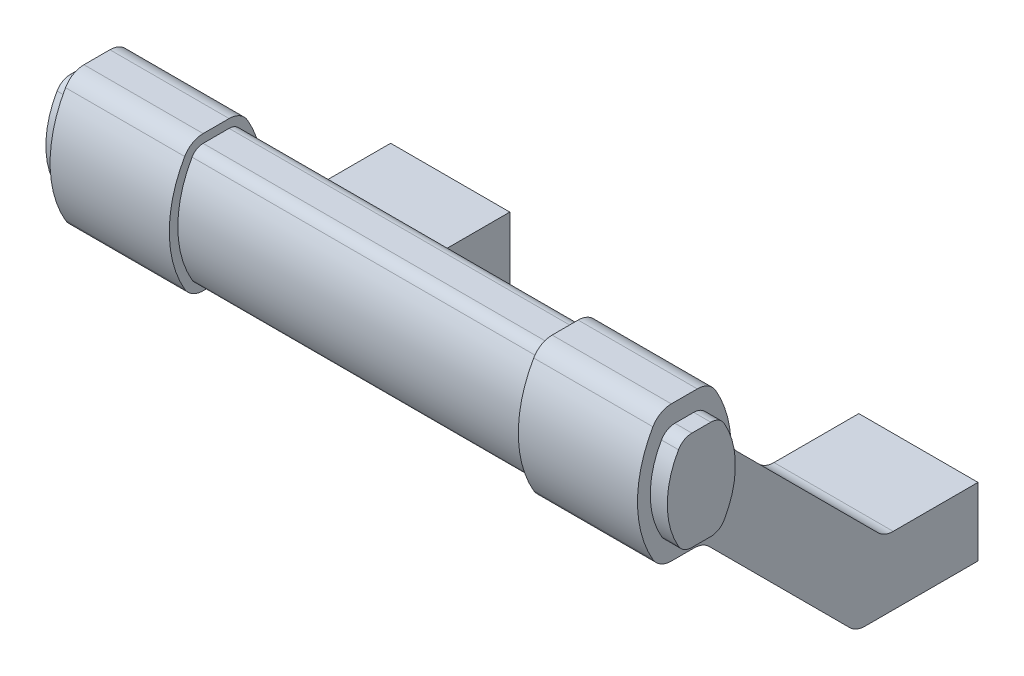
ISO-10303-21;
HEADER;
FILE_DESCRIPTION(('STEP AP214'),'2;1');
FILE_NAME('part.step','',(''),(''),'','','');
FILE_SCHEMA(('AUTOMOTIVE_DESIGN { 1 0 10303 214 1 1 1 1 }'));
ENDSEC;
DATA;
#1=APPLICATION_CONTEXT('core data for automotive mechanical design processes');
#2=APPLICATION_PROTOCOL_DEFINITION('international standard','automotive_design',2000,#1);
#3=PRODUCT_CONTEXT('',#1,'mechanical');
#4=PRODUCT('Part','Part','',(#3));
#5=PRODUCT_RELATED_PRODUCT_CATEGORY('part','',(#4));
#6=PRODUCT_DEFINITION_FORMATION('','',#4);
#7=PRODUCT_DEFINITION_CONTEXT('part definition',#1,'design');
#8=PRODUCT_DEFINITION('design','',#6,#7);
#9=PRODUCT_DEFINITION_SHAPE('','',#8);
#10=(LENGTH_UNIT() NAMED_UNIT(*) SI_UNIT(.MILLI.,.METRE.));
#11=(NAMED_UNIT(*) PLANE_ANGLE_UNIT() SI_UNIT($,.RADIAN.));
#12=(NAMED_UNIT(*) SI_UNIT($,.STERADIAN.) SOLID_ANGLE_UNIT());
#13=UNCERTAINTY_MEASURE_WITH_UNIT(LENGTH_MEASURE(1.E-05),#10,'distance_accuracy_value','');
#14=(GEOMETRIC_REPRESENTATION_CONTEXT(3) GLOBAL_UNCERTAINTY_ASSIGNED_CONTEXT((#13)) GLOBAL_UNIT_ASSIGNED_CONTEXT((#10,
#11,#12)) REPRESENTATION_CONTEXT('',''));
#15=CARTESIAN_POINT('',(0.,0.,0.));
#16=DIRECTION('',(0.,0.,1.));
#17=DIRECTION('',(1.,0.,0.));
#18=AXIS2_PLACEMENT_3D('',#15,#16,#17);
#19=CARTESIAN_POINT('',(-7.,4.03363621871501,0.));
#20=DIRECTION('',(0.,0.,1.));
#21=DIRECTION('',(-1.,0.,0.));
#22=AXIS2_PLACEMENT_3D('',#19,#20,#21);
#23=PLANE('',#22);
#24=CARTESIAN_POINT('',(0.,0.,0.));
#25=DIRECTION('',(0.,0.,-1.));
#26=DIRECTION('',(1.,0.,0.));
#27=AXIS2_PLACEMENT_3D('',#24,#25,#26);
#28=CIRCLE('',#27,2.5);
#29=CARTESIAN_POINT('',(2.5,0.,0.));
#30=VERTEX_POINT('',#29);
#31=EDGE_CURVE('E610',#30,#30,#28,.T.);
#32=ORIENTED_EDGE('',*,*,#31,.F.);
#33=EDGE_LOOP('',(#32));
#34=FACE_BOUND('',#33,.T.);
#35=DIRECTION('',(1.,0.,0.));
#36=VECTOR('',#35,1.);
#37=CARTESIAN_POINT('',(-7.,-3.96636378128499,0.));
#38=LINE('',#37,#36);
#39=CARTESIAN_POINT('',(-7.,-3.96636378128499,0.));
#40=VERTEX_POINT('',#39);
#41=CARTESIAN_POINT('',(7.,-3.96636378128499,0.));
#42=VERTEX_POINT('',#41);
#43=EDGE_CURVE('E9',#40,#42,#38,.T.);
#44=ORIENTED_EDGE('',*,*,#43,.F.);
#45=DIRECTION('',(0.,-1.,0.));
#46=VECTOR('',#45,1.);
#47=CARTESIAN_POINT('',(-7.,4.03363621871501,0.));
#48=LINE('',#47,#46);
#49=CARTESIAN_POINT('',(-7.,4.03363621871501,0.));
#50=VERTEX_POINT('',#49);
#51=EDGE_CURVE('E763',#50,#40,#48,.T.);
#52=ORIENTED_EDGE('',*,*,#51,.F.);
#53=DIRECTION('',(1.,0.,0.));
#54=VECTOR('',#53,1.);
#55=CARTESIAN_POINT('',(-7.,4.03363621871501,0.));
#56=LINE('',#55,#54);
#57=CARTESIAN_POINT('',(7.,4.03363621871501,0.));
#58=VERTEX_POINT('',#57);
#59=EDGE_CURVE('E811',#50,#58,#56,.T.);
#60=ORIENTED_EDGE('',*,*,#59,.T.);
#61=DIRECTION('',(0.,-1.,0.));
#62=VECTOR('',#61,1.);
#63=CARTESIAN_POINT('',(7.,4.03363621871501,0.));
#64=LINE('',#63,#62);
#65=EDGE_CURVE('E715',#58,#42,#64,.T.);
#66=ORIENTED_EDGE('',*,*,#65,.T.);
#67=EDGE_LOOP('',(#44,#52,#60,#66));
#68=FACE_BOUND('',#67,.T.);
#69=ADVANCED_FACE('F14',(#34,#68),#23,.F.);
#70=CARTESIAN_POINT('',(-7.,-3.96636378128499,0.));
#71=DIRECTION('',(0.,1.,0.));
#72=DIRECTION('',(-1.,0.,0.));
#73=AXIS2_PLACEMENT_3D('',#70,#71,#72);
#74=PLANE('',#73);
#75=DIRECTION('',(1.,0.,0.));
#76=VECTOR('',#75,1.);
#77=CARTESIAN_POINT('',(-7.,-3.96636378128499,13.278174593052));
#78=LINE('',#77,#76);
#79=CARTESIAN_POINT('',(-7.,-3.96636378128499,13.278174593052));
#80=VERTEX_POINT('',#79);
#81=CARTESIAN_POINT('',(7.,-3.96636378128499,13.278174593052));
#82=VERTEX_POINT('',#81);
#83=EDGE_CURVE('E22',#80,#82,#78,.T.);
#84=ORIENTED_EDGE('',*,*,#83,.F.);
#85=DIRECTION('',(0.,0.,1.));
#86=VECTOR('',#85,1.);
#87=CARTESIAN_POINT('',(-7.,-3.96636378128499,0.));
#88=LINE('',#87,#86);
#89=EDGE_CURVE('E766',#40,#80,#88,.T.);
#90=ORIENTED_EDGE('',*,*,#89,.F.);
#91=ORIENTED_EDGE('',*,*,#43,.T.);
#92=DIRECTION('',(0.,0.,1.));
#93=VECTOR('',#92,1.);
#94=CARTESIAN_POINT('',(7.,-3.96636378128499,0.));
#95=LINE('',#94,#93);
#96=EDGE_CURVE('E718',#42,#82,#95,.T.);
#97=ORIENTED_EDGE('',*,*,#96,.T.);
#98=EDGE_LOOP('',(#84,#90,#91,#97));
#99=FACE_BOUND('',#98,.T.);
#100=ADVANCED_FACE('F16',(#99),#74,.F.);
#101=CARTESIAN_POINT('',(-7.,-1.46636378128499,13.278174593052));
#102=DIRECTION('',(1.,0.,0.));
#103=DIRECTION('',(0.,1.,0.));
#104=AXIS2_PLACEMENT_3D('',#101,#102,#103);
#105=CYLINDRICAL_SURFACE('',#104,2.49999999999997);
#106=DIRECTION('',(1.,0.,0.));
#107=VECTOR('',#106,1.);
#108=CARTESIAN_POINT('',(-7.,-3.23413073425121,15.0459415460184));
#109=LINE('',#108,#107);
#110=CARTESIAN_POINT('',(-7.,-3.23413073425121,15.0459415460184));
#111=VERTEX_POINT('',#110);
#112=CARTESIAN_POINT('',(7.,-3.23413073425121,15.0459415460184));
#113=VERTEX_POINT('',#112);
#114=EDGE_CURVE('E837',#111,#113,#109,.T.);
#115=ORIENTED_EDGE('',*,*,#114,.F.);
#116=CARTESIAN_POINT('',(-7.,-1.46636378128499,13.278174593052));
#117=DIRECTION('',(-1.,0.,0.));
#118=DIRECTION('',(0.,-1.,0.));
#119=AXIS2_PLACEMENT_3D('',#116,#117,#118);
#120=CIRCLE('',#119,2.49999999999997);
#121=EDGE_CURVE('E769',#80,#111,#120,.T.);
#122=ORIENTED_EDGE('',*,*,#121,.F.);
#123=ORIENTED_EDGE('',*,*,#83,.T.);
#124=CARTESIAN_POINT('',(7.,-1.46636378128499,13.278174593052));
#125=DIRECTION('',(-1.,0.,0.));
#126=DIRECTION('',(0.,-1.,0.));
#127=AXIS2_PLACEMENT_3D('',#124,#125,#126);
#128=CIRCLE('',#127,2.49999999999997);
#129=EDGE_CURVE('E721',#82,#113,#128,.T.);
#130=ORIENTED_EDGE('',*,*,#129,.T.);
#131=EDGE_LOOP('',(#115,#122,#123,#130));
#132=FACE_BOUND('',#131,.T.);
#133=ADVANCED_FACE('F840',(#132),#105,.T.);
#134=CARTESIAN_POINT('',(-7.,13.3014031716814,31.581475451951));
#135=DIRECTION('',(0.,-0.707106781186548,0.707106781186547));
#136=DIRECTION('',(0.,0.707106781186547,0.707106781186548));
#137=AXIS2_PLACEMENT_3D('',#134,#135,#136);
#138=PLANE('',#137);
#139=DIRECTION('',(1.,0.,0.));
#140=VECTOR('',#139,1.);
#141=CARTESIAN_POINT('',(-7.,13.3014031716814,31.581475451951));
#142=LINE('',#141,#140);
#143=CARTESIAN_POINT('',(-7.,13.3014031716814,31.581475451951));
#144=VERTEX_POINT('',#143);
#145=CARTESIAN_POINT('',(7.,13.3014031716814,31.581475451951));
#146=VERTEX_POINT('',#145);
#147=EDGE_CURVE('E835',#144,#146,#142,.T.);
#148=ORIENTED_EDGE('',*,*,#147,.F.);
#149=DIRECTION('',(0.,-0.707106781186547,-0.707106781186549));
#150=VECTOR('',#149,1.);
#151=CARTESIAN_POINT('',(-7.,13.3014031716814,31.581475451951));
#152=LINE('',#151,#150);
#153=EDGE_CURVE('E772',#144,#111,#152,.T.);
#154=ORIENTED_EDGE('',*,*,#153,.T.);
#155=ORIENTED_EDGE('',*,*,#114,.T.);
#156=DIRECTION('',(0.,-0.707106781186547,-0.707106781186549));
#157=VECTOR('',#156,1.);
#158=CARTESIAN_POINT('',(7.,13.3014031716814,31.581475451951));
#159=LINE('',#158,#157);
#160=EDGE_CURVE('E724',#146,#113,#159,.T.);
#161=ORIENTED_EDGE('',*,*,#160,.F.);
#162=EDGE_LOOP('',(#148,#154,#155,#161));
#163=FACE_BOUND('',#162,.T.);
#164=ADVANCED_FACE('F852',(#163),#138,.T.);
#165=CARTESIAN_POINT('',(-7.,11.533636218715,33.3492424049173));
#166=DIRECTION('',(1.,0.,0.));
#167=DIRECTION('',(0.,1.,0.));
#168=AXIS2_PLACEMENT_3D('',#165,#166,#167);
#169=CYLINDRICAL_SURFACE('',#168,2.5);
#170=DIRECTION('',(1.,0.,0.));
#171=VECTOR('',#170,1.);
#172=CARTESIAN_POINT('',(-7.,14.033636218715,33.3492424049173));
#173=LINE('',#172,#171);
#174=CARTESIAN_POINT('',(-7.,14.033636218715,33.3492424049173));
#175=VERTEX_POINT('',#174);
#176=CARTESIAN_POINT('',(7.,14.033636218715,33.3492424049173));
#177=VERTEX_POINT('',#176);
#178=EDGE_CURVE('E833',#175,#177,#173,.T.);
#179=ORIENTED_EDGE('',*,*,#178,.F.);
#180=CARTESIAN_POINT('',(-7.,11.533636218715,33.3492424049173));
#181=DIRECTION('',(-1.,0.,0.));
#182=DIRECTION('',(0.,-1.,0.));
#183=AXIS2_PLACEMENT_3D('',#180,#181,#182);
#184=CIRCLE('',#183,2.5);
#185=EDGE_CURVE('E775',#175,#144,#184,.T.);
#186=ORIENTED_EDGE('',*,*,#185,.T.);
#187=ORIENTED_EDGE('',*,*,#147,.T.);
#188=CARTESIAN_POINT('',(7.,11.533636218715,33.3492424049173));
#189=DIRECTION('',(-1.,0.,0.));
#190=DIRECTION('',(0.,-1.,0.));
#191=AXIS2_PLACEMENT_3D('',#188,#189,#190);
#192=CIRCLE('',#191,2.5);
#193=EDGE_CURVE('E727',#177,#146,#192,.T.);
#194=ORIENTED_EDGE('',*,*,#193,.F.);
#195=EDGE_LOOP('',(#179,#186,#187,#194));
#196=FACE_BOUND('',#195,.T.);
#197=ADVANCED_FACE('F903',(#196),#169,.F.);
#198=CARTESIAN_POINT('',(-7.,14.033636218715,33.3492424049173));
#199=DIRECTION('',(0.,1.,0.));
#200=DIRECTION('',(-1.,0.,0.));
#201=AXIS2_PLACEMENT_3D('',#198,#199,#200);
#202=PLANE('',#201);
#203=DIRECTION('',(1.,0.,0.));
#204=VECTOR('',#203,1.);
#205=CARTESIAN_POINT('',(-7.,14.033636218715,36.0262794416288));
#206=LINE('',#205,#204);
#207=CARTESIAN_POINT('',(-7.,14.033636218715,36.0262794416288));
#208=VERTEX_POINT('',#207);
#209=CARTESIAN_POINT('',(7.,14.033636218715,36.0262794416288));
#210=VERTEX_POINT('',#209);
#211=EDGE_CURVE('E831',#208,#210,#206,.T.);
#212=ORIENTED_EDGE('',*,*,#211,.F.);
#213=DIRECTION('',(0.,0.,1.));
#214=VECTOR('',#213,1.);
#215=CARTESIAN_POINT('',(-7.,14.033636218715,33.3492424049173));
#216=LINE('',#215,#214);
#217=EDGE_CURVE('E778',#175,#208,#216,.T.);
#218=ORIENTED_EDGE('',*,*,#217,.F.);
#219=ORIENTED_EDGE('',*,*,#178,.T.);
#220=DIRECTION('',(0.,0.,1.));
#221=VECTOR('',#220,1.);
#222=CARTESIAN_POINT('',(7.,14.033636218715,33.3492424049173));
#223=LINE('',#222,#221);
#224=EDGE_CURVE('E730',#177,#210,#223,.T.);
#225=ORIENTED_EDGE('',*,*,#224,.T.);
#226=EDGE_LOOP('',(#212,#218,#219,#225));
#227=FACE_BOUND('',#226,.T.);
#228=ADVANCED_FACE('F901',(#227),#202,.F.);
#229=CARTESIAN_POINT('',(-7.,16.533636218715,36.0262794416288));
#230=DIRECTION('',(1.,0.,0.));
#231=DIRECTION('',(0.,1.,0.));
#232=AXIS2_PLACEMENT_3D('',#229,#230,#231);
#233=CYLINDRICAL_SURFACE('',#232,2.5);
#234=DIRECTION('',(1.,0.,0.));
#235=VECTOR('',#234,1.);
#236=CARTESIAN_POINT('',(-7.,15.283636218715,38.1913429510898));
#237=LINE('',#236,#235);
#238=CARTESIAN_POINT('',(-7.,15.283636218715,38.1913429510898));
#239=VERTEX_POINT('',#238);
#240=CARTESIAN_POINT('',(7.,15.283636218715,38.1913429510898));
#241=VERTEX_POINT('',#240);
#242=EDGE_CURVE('E829',#239,#241,#237,.T.);
#243=ORIENTED_EDGE('',*,*,#242,.F.);
#244=CARTESIAN_POINT('',(-7.,16.533636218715,36.0262794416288));
#245=DIRECTION('',(-1.,0.,0.));
#246=DIRECTION('',(0.,-1.,0.));
#247=AXIS2_PLACEMENT_3D('',#244,#245,#246);
#248=CIRCLE('',#247,2.5);
#249=EDGE_CURVE('E781',#208,#239,#248,.T.);
#250=ORIENTED_EDGE('',*,*,#249,.F.);
#251=ORIENTED_EDGE('',*,*,#211,.T.);
#252=CARTESIAN_POINT('',(7.,16.533636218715,36.0262794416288));
#253=DIRECTION('',(-1.,0.,0.));
#254=DIRECTION('',(0.,-1.,0.));
#255=AXIS2_PLACEMENT_3D('',#252,#253,#254);
#256=CIRCLE('',#255,2.5);
#257=EDGE_CURVE('E733',#210,#241,#256,.T.);
#258=ORIENTED_EDGE('',*,*,#257,.T.);
#259=EDGE_LOOP('',(#243,#250,#251,#258));
#260=FACE_BOUND('',#259,.T.);
#261=ADVANCED_FACE('F898',(#260),#233,.T.);
#262=CARTESIAN_POINT('',(-7.,22.033636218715,26.5));
#263=DIRECTION('',(1.,0.,0.));
#264=DIRECTION('',(0.,1.,0.));
#265=AXIS2_PLACEMENT_3D('',#262,#263,#264);
#266=CYLINDRICAL_SURFACE('',#265,13.5);
#267=DIRECTION('',(1.,0.,0.));
#268=VECTOR('',#267,1.);
#269=CARTESIAN_POINT('',(-7.,28.783636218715,38.1913429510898));
#270=LINE('',#269,#268);
#271=CARTESIAN_POINT('',(-7.,28.783636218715,38.1913429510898));
#272=VERTEX_POINT('',#271);
#273=CARTESIAN_POINT('',(7.,28.783636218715,38.1913429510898));
#274=VERTEX_POINT('',#273);
#275=EDGE_CURVE('E827',#272,#274,#270,.T.);
#276=ORIENTED_EDGE('',*,*,#275,.F.);
#277=CARTESIAN_POINT('',(-7.,22.033636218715,26.5));
#278=DIRECTION('',(-1.,0.,0.));
#279=DIRECTION('',(0.,-1.,0.));
#280=AXIS2_PLACEMENT_3D('',#277,#278,#279);
#281=CIRCLE('',#280,13.5);
#282=EDGE_CURVE('E784',#239,#272,#281,.T.);
#283=ORIENTED_EDGE('',*,*,#282,.F.);
#284=ORIENTED_EDGE('',*,*,#242,.T.);
#285=CARTESIAN_POINT('',(7.,22.033636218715,26.5));
#286=DIRECTION('',(-1.,0.,0.));
#287=DIRECTION('',(0.,-1.,0.));
#288=AXIS2_PLACEMENT_3D('',#285,#286,#287);
#289=CIRCLE('',#288,13.5);
#290=EDGE_CURVE('E736',#241,#274,#289,.T.);
#291=ORIENTED_EDGE('',*,*,#290,.T.);
#292=EDGE_LOOP('',(#276,#283,#284,#291));
#293=FACE_BOUND('',#292,.T.);
#294=ADVANCED_FACE('F894',(#293),#266,.T.);
#295=CARTESIAN_POINT('',(-7.,27.533636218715,36.0262794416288));
#296=DIRECTION('',(1.,0.,0.));
#297=DIRECTION('',(0.,1.,0.));
#298=AXIS2_PLACEMENT_3D('',#295,#296,#297);
#299=CYLINDRICAL_SURFACE('',#298,2.5);
#300=DIRECTION('',(1.,0.,0.));
#301=VECTOR('',#300,1.);
#302=CARTESIAN_POINT('',(-7.,30.033636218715,36.0262794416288));
#303=LINE('',#302,#301);
#304=CARTESIAN_POINT('',(-7.,30.033636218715,36.0262794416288));
#305=VERTEX_POINT('',#304);
#306=CARTESIAN_POINT('',(7.,30.033636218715,36.0262794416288));
#307=VERTEX_POINT('',#306);
#308=EDGE_CURVE('E825',#305,#307,#303,.T.);
#309=ORIENTED_EDGE('',*,*,#308,.F.);
#310=CARTESIAN_POINT('',(-7.,27.533636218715,36.0262794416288));
#311=DIRECTION('',(-1.,0.,0.));
#312=DIRECTION('',(0.,-1.,0.));
#313=AXIS2_PLACEMENT_3D('',#310,#311,#312);
#314=CIRCLE('',#313,2.5);
#315=EDGE_CURVE('E787',#272,#305,#314,.T.);
#316=ORIENTED_EDGE('',*,*,#315,.F.);
#317=ORIENTED_EDGE('',*,*,#275,.T.);
#318=CARTESIAN_POINT('',(7.,27.533636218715,36.0262794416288));
#319=DIRECTION('',(-1.,0.,0.));
#320=DIRECTION('',(0.,-1.,0.));
#321=AXIS2_PLACEMENT_3D('',#318,#319,#320);
#322=CIRCLE('',#321,2.5);
#323=EDGE_CURVE('E739',#274,#307,#322,.T.);
#324=ORIENTED_EDGE('',*,*,#323,.T.);
#325=EDGE_LOOP('',(#309,#316,#317,#324));
#326=FACE_BOUND('',#325,.T.);
#327=ADVANCED_FACE('F890',(#326),#299,.T.);
#328=CARTESIAN_POINT('',(-7.,30.033636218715,32.9737205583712));
#329=DIRECTION('',(0.,1.,0.));
#330=DIRECTION('',(-1.,0.,0.));
#331=AXIS2_PLACEMENT_3D('',#328,#329,#330);
#332=PLANE('',#331);
#333=DIRECTION('',(1.,0.,0.));
#334=VECTOR('',#333,1.);
#335=CARTESIAN_POINT('',(-7.,30.033636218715,32.9737205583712));
#336=LINE('',#335,#334);
#337=CARTESIAN_POINT('',(-7.,30.033636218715,32.9737205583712));
#338=VERTEX_POINT('',#337);
#339=CARTESIAN_POINT('',(7.,30.033636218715,32.9737205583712));
#340=VERTEX_POINT('',#339);
#341=EDGE_CURVE('E823',#338,#340,#336,.T.);
#342=ORIENTED_EDGE('',*,*,#341,.F.);
#343=DIRECTION('',(0.,0.,1.));
#344=VECTOR('',#343,1.);
#345=CARTESIAN_POINT('',(-7.,30.033636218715,32.9737205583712));
#346=LINE('',#345,#344);
#347=EDGE_CURVE('E790',#338,#305,#346,.T.);
#348=ORIENTED_EDGE('',*,*,#347,.T.);
#349=ORIENTED_EDGE('',*,*,#308,.T.);
#350=DIRECTION('',(0.,0.,1.));
#351=VECTOR('',#350,1.);
#352=CARTESIAN_POINT('',(7.,30.033636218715,32.9737205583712));
#353=LINE('',#352,#351);
#354=EDGE_CURVE('E742',#340,#307,#353,.T.);
#355=ORIENTED_EDGE('',*,*,#354,.F.);
#356=EDGE_LOOP('',(#342,#348,#349,#355));
#357=FACE_BOUND('',#356,.T.);
#358=ADVANCED_FACE('F887',(#357),#332,.T.);
#359=CARTESIAN_POINT('',(-7.,27.533636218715,32.9737205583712));
#360=DIRECTION('',(1.,0.,0.));
#361=DIRECTION('',(0.,1.,0.));
#362=AXIS2_PLACEMENT_3D('',#359,#360,#361);
#363=CYLINDRICAL_SURFACE('',#362,2.5);
#364=DIRECTION('',(1.,0.,0.));
#365=VECTOR('',#364,1.);
#366=CARTESIAN_POINT('',(-7.,28.783636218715,30.80865704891));
#367=LINE('',#366,#365);
#368=CARTESIAN_POINT('',(-7.,28.783636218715,30.80865704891));
#369=VERTEX_POINT('',#368);
#370=CARTESIAN_POINT('',(7.,28.783636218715,30.80865704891));
#371=VERTEX_POINT('',#370);
#372=EDGE_CURVE('E821',#369,#371,#367,.T.);
#373=ORIENTED_EDGE('',*,*,#372,.F.);
#374=CARTESIAN_POINT('',(-7.,27.533636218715,32.9737205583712));
#375=DIRECTION('',(-1.,0.,0.));
#376=DIRECTION('',(0.,-1.,0.));
#377=AXIS2_PLACEMENT_3D('',#374,#375,#376);
#378=CIRCLE('',#377,2.5);
#379=EDGE_CURVE('E793',#338,#369,#378,.T.);
#380=ORIENTED_EDGE('',*,*,#379,.F.);
#381=ORIENTED_EDGE('',*,*,#341,.T.);
#382=CARTESIAN_POINT('',(7.,27.533636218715,32.9737205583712));
#383=DIRECTION('',(-1.,0.,0.));
#384=DIRECTION('',(0.,-1.,0.));
#385=AXIS2_PLACEMENT_3D('',#382,#383,#384);
#386=CIRCLE('',#385,2.5);
#387=EDGE_CURVE('E745',#340,#371,#386,.T.);
#388=ORIENTED_EDGE('',*,*,#387,.T.);
#389=EDGE_LOOP('',(#373,#380,#381,#388));
#390=FACE_BOUND('',#389,.T.);
#391=ADVANCED_FACE('F883',(#390),#363,.T.);
#392=CARTESIAN_POINT('',(-7.,22.033636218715,42.5));
#393=DIRECTION('',(1.,0.,0.));
#394=DIRECTION('',(0.,1.,0.));
#395=AXIS2_PLACEMENT_3D('',#392,#393,#394);
#396=CYLINDRICAL_SURFACE('',#395,13.5);
#397=DIRECTION('',(1.,0.,0.));
#398=VECTOR('',#397,1.);
#399=CARTESIAN_POINT('',(-7.,22.9376715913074,29.0303036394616));
#400=LINE('',#399,#398);
#401=CARTESIAN_POINT('',(-7.,22.9376715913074,29.0303036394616));
#402=VERTEX_POINT('',#401);
#403=CARTESIAN_POINT('',(7.,22.9376715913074,29.0303036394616));
#404=VERTEX_POINT('',#403);
#405=EDGE_CURVE('E819',#402,#404,#400,.T.);
#406=ORIENTED_EDGE('',*,*,#405,.F.);
#407=CARTESIAN_POINT('',(-7.,22.033636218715,42.5));
#408=DIRECTION('',(-1.,0.,0.));
#409=DIRECTION('',(0.,-1.,0.));
#410=AXIS2_PLACEMENT_3D('',#407,#408,#409);
#411=CIRCLE('',#410,13.5);
#412=EDGE_CURVE('E796',#369,#402,#411,.T.);
#413=ORIENTED_EDGE('',*,*,#412,.F.);
#414=ORIENTED_EDGE('',*,*,#372,.T.);
#415=CARTESIAN_POINT('',(7.,22.033636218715,42.5));
#416=DIRECTION('',(-1.,0.,0.));
#417=DIRECTION('',(0.,-1.,0.));
#418=AXIS2_PLACEMENT_3D('',#415,#416,#417);
#419=CIRCLE('',#418,13.5);
#420=EDGE_CURVE('E748',#371,#404,#419,.T.);
#421=ORIENTED_EDGE('',*,*,#420,.T.);
#422=EDGE_LOOP('',(#406,#413,#414,#421));
#423=FACE_BOUND('',#422,.T.);
#424=ADVANCED_FACE('F878',(#423),#396,.T.);
#425=CARTESIAN_POINT('',(-7.,23.1050855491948,26.535915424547));
#426=DIRECTION('',(1.,0.,0.));
#427=DIRECTION('',(0.,1.,0.));
#428=AXIS2_PLACEMENT_3D('',#425,#426,#427);
#429=CYLINDRICAL_SURFACE('',#428,2.5);
#430=DIRECTION('',(1.,0.,0.));
#431=VECTOR('',#430,1.);
#432=CARTESIAN_POINT('',(-7.,21.3373185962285,28.3036823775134));
#433=LINE('',#432,#431);
#434=CARTESIAN_POINT('',(-7.,21.3373185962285,28.3036823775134));
#435=VERTEX_POINT('',#434);
#436=CARTESIAN_POINT('',(7.,21.3373185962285,28.3036823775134));
#437=VERTEX_POINT('',#436);
#438=EDGE_CURVE('E817',#435,#437,#433,.T.);
#439=ORIENTED_EDGE('',*,*,#438,.F.);
#440=CARTESIAN_POINT('',(-7.,23.1050855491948,26.535915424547));
#441=DIRECTION('',(-1.,0.,0.));
#442=DIRECTION('',(0.,-1.,0.));
#443=AXIS2_PLACEMENT_3D('',#440,#441,#442);
#444=CIRCLE('',#443,2.5);
#445=EDGE_CURVE('E799',#435,#402,#444,.T.);
#446=ORIENTED_EDGE('',*,*,#445,.T.);
#447=ORIENTED_EDGE('',*,*,#405,.T.);
#448=CARTESIAN_POINT('',(7.,23.1050855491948,26.535915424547));
#449=DIRECTION('',(-1.,0.,0.));
#450=DIRECTION('',(0.,-1.,0.));
#451=AXIS2_PLACEMENT_3D('',#448,#449,#450);
#452=CIRCLE('',#451,2.5);
#453=EDGE_CURVE('E751',#437,#404,#452,.T.);
#454=ORIENTED_EDGE('',*,*,#453,.F.);
#455=EDGE_LOOP('',(#439,#446,#447,#454));
#456=FACE_BOUND('',#455,.T.);
#457=ADVANCED_FACE('F875',(#456),#429,.F.);
#458=CARTESIAN_POINT('',(-7.,21.3373185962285,28.3036823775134));
#459=DIRECTION('',(0.,-0.707106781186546,0.707106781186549));
#460=DIRECTION('',(0.,0.707106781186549,0.707106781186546));
#461=AXIS2_PLACEMENT_3D('',#458,#459,#460);
#462=PLANE('',#461);
#463=DIRECTION('',(1.,0.,0.));
#464=VECTOR('',#463,1.);
#465=CARTESIAN_POINT('',(-7.,4.76586926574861,11.7322330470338));
#466=LINE('',#465,#464);
#467=CARTESIAN_POINT('',(-7.,4.76586926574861,11.7322330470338));
#468=VERTEX_POINT('',#467);
#469=CARTESIAN_POINT('',(7.,4.76586926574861,11.7322330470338));
#470=VERTEX_POINT('',#469);
#471=EDGE_CURVE('E815',#468,#470,#466,.T.);
#472=ORIENTED_EDGE('',*,*,#471,.F.);
#473=DIRECTION('',(0.,-0.707106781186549,-0.707106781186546));
#474=VECTOR('',#473,1.);
#475=CARTESIAN_POINT('',(-7.,21.3373185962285,28.3036823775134));
#476=LINE('',#475,#474);
#477=EDGE_CURVE('E802',#435,#468,#476,.T.);
#478=ORIENTED_EDGE('',*,*,#477,.F.);
#479=ORIENTED_EDGE('',*,*,#438,.T.);
#480=DIRECTION('',(0.,-0.707106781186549,-0.707106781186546));
#481=VECTOR('',#480,1.);
#482=CARTESIAN_POINT('',(7.,21.3373185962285,28.3036823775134));
#483=LINE('',#482,#481);
#484=EDGE_CURVE('E754',#437,#470,#483,.T.);
#485=ORIENTED_EDGE('',*,*,#484,.T.);
#486=EDGE_LOOP('',(#472,#478,#479,#485));
#487=FACE_BOUND('',#486,.T.);
#488=ADVANCED_FACE('F871',(#487),#462,.F.);
#489=CARTESIAN_POINT('',(-7.,6.53363621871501,9.9644660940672));
#490=DIRECTION('',(1.,0.,0.));
#491=DIRECTION('',(0.,1.,0.));
#492=AXIS2_PLACEMENT_3D('',#489,#490,#491);
#493=CYLINDRICAL_SURFACE('',#492,2.5);
#494=DIRECTION('',(1.,0.,0.));
#495=VECTOR('',#494,1.);
#496=CARTESIAN_POINT('',(-7.,4.03363621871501,9.9644660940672));
#497=LINE('',#496,#495);
#498=CARTESIAN_POINT('',(-7.,4.03363621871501,9.9644660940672));
#499=VERTEX_POINT('',#498);
#500=CARTESIAN_POINT('',(7.,4.03363621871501,9.9644660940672));
#501=VERTEX_POINT('',#500);
#502=EDGE_CURVE('E813',#499,#501,#497,.T.);
#503=ORIENTED_EDGE('',*,*,#502,.F.);
#504=CARTESIAN_POINT('',(-7.,6.53363621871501,9.9644660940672));
#505=DIRECTION('',(-1.,0.,0.));
#506=DIRECTION('',(0.,-1.,0.));
#507=AXIS2_PLACEMENT_3D('',#504,#505,#506);
#508=CIRCLE('',#507,2.5);
#509=EDGE_CURVE('E805',#499,#468,#508,.T.);
#510=ORIENTED_EDGE('',*,*,#509,.T.);
#511=ORIENTED_EDGE('',*,*,#471,.T.);
#512=CARTESIAN_POINT('',(7.,6.53363621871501,9.9644660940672));
#513=DIRECTION('',(-1.,0.,0.));
#514=DIRECTION('',(0.,-1.,0.));
#515=AXIS2_PLACEMENT_3D('',#512,#513,#514);
#516=CIRCLE('',#515,2.5);
#517=EDGE_CURVE('E757',#501,#470,#516,.T.);
#518=ORIENTED_EDGE('',*,*,#517,.F.);
#519=EDGE_LOOP('',(#503,#510,#511,#518));
#520=FACE_BOUND('',#519,.T.);
#521=ADVANCED_FACE('F866',(#520),#493,.F.);
#522=CARTESIAN_POINT('',(-7.,4.03363621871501,0.));
#523=DIRECTION('',(0.,1.,0.));
#524=DIRECTION('',(-1.,0.,0.));
#525=AXIS2_PLACEMENT_3D('',#522,#523,#524);
#526=PLANE('',#525);
#527=DIRECTION('',(0.,0.,1.));
#528=VECTOR('',#527,1.);
#529=CARTESIAN_POINT('',(-7.,4.03363621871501,0.));
#530=LINE('',#529,#528);
#531=EDGE_CURVE('E808',#50,#499,#530,.T.);
#532=ORIENTED_EDGE('',*,*,#531,.T.);
#533=ORIENTED_EDGE('',*,*,#502,.T.);
#534=DIRECTION('',(0.,0.,1.));
#535=VECTOR('',#534,1.);
#536=CARTESIAN_POINT('',(7.,4.03363621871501,0.));
#537=LINE('',#536,#535);
#538=EDGE_CURVE('E760',#58,#501,#537,.T.);
#539=ORIENTED_EDGE('',*,*,#538,.F.);
#540=ORIENTED_EDGE('',*,*,#59,.F.);
#541=EDGE_LOOP('',(#532,#533,#539,#540));
#542=FACE_BOUND('',#541,.T.);
#543=ADVANCED_FACE('F863',(#542),#526,.T.);
#544=CARTESIAN_POINT('',(-7.,-1.46636378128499,13.278174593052));
#545=DIRECTION('',(-1.,0.,0.));
#546=DIRECTION('',(0.,-1.,0.));
#547=AXIS2_PLACEMENT_3D('',#544,#545,#546);
#548=PLANE('',#547);
#549=CARTESIAN_POINT('',(-7.,18.033636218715,35.6100214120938));
#550=DIRECTION('',(-1.,0.,0.));
#551=DIRECTION('',(0.,-1.,0.));
#552=AXIS2_PLACEMENT_3D('',#549,#550,#551);
#553=CIRCLE('',#552,1.81818181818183);
#554=CARTESIAN_POINT('',(-7.,16.2154544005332,35.6100214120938));
#555=VERTEX_POINT('',#554);
#556=CARTESIAN_POINT('',(-7.,17.1245453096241,37.1846130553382));
#557=VERTEX_POINT('',#556);
#558=EDGE_CURVE('E37',#555,#557,#553,.T.);
#559=ORIENTED_EDGE('',*,*,#558,.F.);
#560=DIRECTION('',(0.,0.,1.));
#561=VECTOR('',#560,1.);
#562=CARTESIAN_POINT('',(-7.,16.2154544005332,33.3899785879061));
#563=LINE('',#562,#561);
#564=CARTESIAN_POINT('',(-7.,16.2154544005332,33.3899785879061));
#565=VERTEX_POINT('',#564);
#566=EDGE_CURVE('E665',#565,#555,#563,.T.);
#567=ORIENTED_EDGE('',*,*,#566,.F.);
#568=CARTESIAN_POINT('',(-7.,18.033636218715,33.3899785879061));
#569=DIRECTION('',(-1.,0.,0.));
#570=DIRECTION('',(0.,-1.,0.));
#571=AXIS2_PLACEMENT_3D('',#568,#569,#570);
#572=CIRCLE('',#571,1.81818181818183);
#573=CARTESIAN_POINT('',(-7.,17.1245453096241,31.8153869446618));
#574=VERTEX_POINT('',#573);
#575=EDGE_CURVE('E662',#574,#565,#572,.T.);
#576=ORIENTED_EDGE('',*,*,#575,.F.);
#577=CARTESIAN_POINT('',(-7.,22.033636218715,40.3181818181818));
#578=DIRECTION('',(-1.,0.,0.));
#579=DIRECTION('',(0.,-1.,0.));
#580=AXIS2_PLACEMENT_3D('',#577,#578,#579);
#581=CIRCLE('',#580,9.81818181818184);
#582=CARTESIAN_POINT('',(-7.,26.9427271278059,31.8153869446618));
#583=VERTEX_POINT('',#582);
#584=EDGE_CURVE('E659',#583,#574,#581,.T.);
#585=ORIENTED_EDGE('',*,*,#584,.F.);
#586=CARTESIAN_POINT('',(-7.,26.033636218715,33.3899785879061));
#587=DIRECTION('',(-1.,0.,0.));
#588=DIRECTION('',(0.,-1.,0.));
#589=AXIS2_PLACEMENT_3D('',#586,#587,#588);
#590=CIRCLE('',#589,1.81818181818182);
#591=CARTESIAN_POINT('',(-7.,27.8518180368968,33.3899785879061));
#592=VERTEX_POINT('',#591);
#593=EDGE_CURVE('E656',#592,#583,#590,.T.);
#594=ORIENTED_EDGE('',*,*,#593,.F.);
#595=DIRECTION('',(0.,0.,1.));
#596=VECTOR('',#595,1.);
#597=CARTESIAN_POINT('',(-7.,27.8518180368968,33.3899785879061));
#598=LINE('',#597,#596);
#599=CARTESIAN_POINT('',(-7.,27.8518180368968,35.6100214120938));
#600=VERTEX_POINT('',#599);
#601=EDGE_CURVE('E654',#592,#600,#598,.T.);
#602=ORIENTED_EDGE('',*,*,#601,.T.);
#603=CARTESIAN_POINT('',(-7.,26.033636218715,35.6100214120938));
#604=DIRECTION('',(-1.,0.,0.));
#605=DIRECTION('',(0.,-1.,0.));
#606=AXIS2_PLACEMENT_3D('',#603,#604,#605);
#607=CIRCLE('',#606,1.81818181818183);
#608=CARTESIAN_POINT('',(-7.,26.9427271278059,37.1846130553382));
#609=VERTEX_POINT('',#608);
#610=EDGE_CURVE('E651',#609,#600,#607,.T.);
#611=ORIENTED_EDGE('',*,*,#610,.F.);
#612=CARTESIAN_POINT('',(-7.,22.033636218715,28.6818181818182));
#613=DIRECTION('',(-1.,0.,0.));
#614=DIRECTION('',(0.,-1.,0.));
#615=AXIS2_PLACEMENT_3D('',#612,#613,#614);
#616=CIRCLE('',#615,9.81818181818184);
#617=EDGE_CURVE('E648',#557,#609,#616,.T.);
#618=ORIENTED_EDGE('',*,*,#617,.F.);
#619=EDGE_LOOP('',(#559,#567,#576,#585,#594,#602,#611,#618));
#620=FACE_BOUND('',#619,.T.);
#621=ORIENTED_EDGE('',*,*,#51,.T.);
#622=ORIENTED_EDGE('',*,*,#89,.T.);
#623=ORIENTED_EDGE('',*,*,#121,.T.);
#624=ORIENTED_EDGE('',*,*,#153,.F.);
#625=ORIENTED_EDGE('',*,*,#185,.F.);
#626=ORIENTED_EDGE('',*,*,#217,.T.);
#627=ORIENTED_EDGE('',*,*,#249,.T.);
#628=ORIENTED_EDGE('',*,*,#282,.T.);
#629=ORIENTED_EDGE('',*,*,#315,.T.);
#630=ORIENTED_EDGE('',*,*,#347,.F.);
#631=ORIENTED_EDGE('',*,*,#379,.T.);
#632=ORIENTED_EDGE('',*,*,#412,.T.);
#633=ORIENTED_EDGE('',*,*,#445,.F.);
#634=ORIENTED_EDGE('',*,*,#477,.T.);
#635=ORIENTED_EDGE('',*,*,#509,.F.);
#636=ORIENTED_EDGE('',*,*,#531,.F.);
#637=EDGE_LOOP('',(#621,#622,#623,#624,#625,#626,#627,#628,#629,#630,#631,#632,#633,#634,#635,#636));
#638=FACE_BOUND('',#637,.T.);
#639=ADVANCED_FACE('F855',(#620,#638),#548,.T.);
#640=CARTESIAN_POINT('',(7.,-1.46636378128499,13.278174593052));
#641=DIRECTION('',(-1.,0.,0.));
#642=DIRECTION('',(0.,-1.,0.));
#643=AXIS2_PLACEMENT_3D('',#640,#641,#642);
#644=PLANE('',#643);
#645=CARTESIAN_POINT('',(7.,22.033636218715,42.5));
#646=DIRECTION('',(-1.,0.,0.));
#647=DIRECTION('',(0.,-1.,0.));
#648=AXIS2_PLACEMENT_3D('',#645,#646,#647);
#649=CIRCLE('',#648,12.5);
#650=CARTESIAN_POINT('',(7.,28.2836362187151,31.6746824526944));
#651=VERTEX_POINT('',#650);
#652=CARTESIAN_POINT('',(7.,15.783636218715,31.6746824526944));
#653=VERTEX_POINT('',#652);
#654=EDGE_CURVE('E374',#651,#653,#649,.T.);
#655=ORIENTED_EDGE('',*,*,#654,.T.);
#656=CARTESIAN_POINT('',(7.,16.533636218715,32.973720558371));
#657=DIRECTION('',(-1.,0.,0.));
#658=DIRECTION('',(0.,-1.,0.));
#659=AXIS2_PLACEMENT_3D('',#656,#657,#658);
#660=CIRCLE('',#659,1.49999999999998);
#661=CARTESIAN_POINT('',(7.,15.033636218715,32.973720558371));
#662=VERTEX_POINT('',#661);
#663=EDGE_CURVE('E29',#653,#662,#660,.T.);
#664=ORIENTED_EDGE('',*,*,#663,.T.);
#665=DIRECTION('',(0.,0.,1.));
#666=VECTOR('',#665,1.);
#667=CARTESIAN_POINT('',(7.,15.033636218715,32.973720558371));
#668=LINE('',#667,#666);
#669=CARTESIAN_POINT('',(7.,15.033636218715,36.0262794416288));
#670=VERTEX_POINT('',#669);
#671=EDGE_CURVE('E371',#662,#670,#668,.T.);
#672=ORIENTED_EDGE('',*,*,#671,.T.);
#673=CARTESIAN_POINT('',(7.,16.533636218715,36.0262794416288));
#674=DIRECTION('',(1.,0.,0.));
#675=DIRECTION('',(0.,1.,0.));
#676=AXIS2_PLACEMENT_3D('',#673,#674,#675);
#677=CIRCLE('',#676,1.49999999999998);
#678=CARTESIAN_POINT('',(7.,15.783636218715,37.3253175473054));
#679=VERTEX_POINT('',#678);
#680=EDGE_CURVE('E618',#679,#670,#677,.T.);
#681=ORIENTED_EDGE('',*,*,#680,.F.);
#682=CARTESIAN_POINT('',(7.,22.033636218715,26.5));
#683=DIRECTION('',(1.,0.,0.));
#684=DIRECTION('',(0.,1.,0.));
#685=AXIS2_PLACEMENT_3D('',#682,#683,#684);
#686=CIRCLE('',#685,12.5);
#687=CARTESIAN_POINT('',(7.,28.283636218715,37.3253175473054));
#688=VERTEX_POINT('',#687);
#689=EDGE_CURVE('E621',#688,#679,#686,.T.);
#690=ORIENTED_EDGE('',*,*,#689,.F.);
#691=CARTESIAN_POINT('',(7.,27.533636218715,36.0262794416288));
#692=DIRECTION('',(1.,0.,0.));
#693=DIRECTION('',(0.,1.,0.));
#694=AXIS2_PLACEMENT_3D('',#691,#692,#693);
#695=CIRCLE('',#694,1.5);
#696=CARTESIAN_POINT('',(7.,29.033636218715,36.0262794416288));
#697=VERTEX_POINT('',#696);
#698=EDGE_CURVE('E624',#697,#688,#695,.T.);
#699=ORIENTED_EDGE('',*,*,#698,.F.);
#700=DIRECTION('',(0.,0.,1.));
#701=VECTOR('',#700,1.);
#702=CARTESIAN_POINT('',(7.,29.033636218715,32.9737205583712));
#703=LINE('',#702,#701);
#704=CARTESIAN_POINT('',(7.,29.033636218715,32.9737205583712));
#705=VERTEX_POINT('',#704);
#706=EDGE_CURVE('E627',#705,#697,#703,.T.);
#707=ORIENTED_EDGE('',*,*,#706,.F.);
#708=CARTESIAN_POINT('',(7.,27.533636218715,32.9737205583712));
#709=DIRECTION('',(-1.,0.,0.));
#710=DIRECTION('',(0.,-1.,0.));
#711=AXIS2_PLACEMENT_3D('',#708,#709,#710);
#712=CIRCLE('',#711,1.50000000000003);
#713=EDGE_CURVE('E630',#705,#651,#712,.T.);
#714=ORIENTED_EDGE('',*,*,#713,.T.);
#715=EDGE_LOOP('',(#655,#664,#672,#681,#690,#699,#707,#714));
#716=FACE_BOUND('',#715,.T.);
#717=ORIENTED_EDGE('',*,*,#65,.F.);
#718=ORIENTED_EDGE('',*,*,#538,.T.);
#719=ORIENTED_EDGE('',*,*,#517,.T.);
#720=ORIENTED_EDGE('',*,*,#484,.F.);
#721=ORIENTED_EDGE('',*,*,#453,.T.);
#722=ORIENTED_EDGE('',*,*,#420,.F.);
#723=ORIENTED_EDGE('',*,*,#387,.F.);
#724=ORIENTED_EDGE('',*,*,#354,.T.);
#725=ORIENTED_EDGE('',*,*,#323,.F.);
#726=ORIENTED_EDGE('',*,*,#290,.F.);
#727=ORIENTED_EDGE('',*,*,#257,.F.);
#728=ORIENTED_EDGE('',*,*,#224,.F.);
#729=ORIENTED_EDGE('',*,*,#193,.T.);
#730=ORIENTED_EDGE('',*,*,#160,.T.);
#731=ORIENTED_EDGE('',*,*,#129,.F.);
#732=ORIENTED_EDGE('',*,*,#96,.F.);
#733=EDGE_LOOP('',(#717,#718,#719,#720,#721,#722,#723,#724,#725,#726,#727,#728,#729,#730,#731,#732));
#734=FACE_BOUND('',#733,.T.);
#735=ADVANCED_FACE('F847',(#716,#734),#644,.F.);
#736=CARTESIAN_POINT('',(-9.,18.033636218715,35.6100214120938));
#737=DIRECTION('',(1.,0.,0.));
#738=DIRECTION('',(0.,1.,0.));
#739=AXIS2_PLACEMENT_3D('',#736,#737,#738);
#740=CYLINDRICAL_SURFACE('',#739,1.81818181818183);
#741=DIRECTION('',(1.,0.,0.));
#742=VECTOR('',#741,1.);
#743=CARTESIAN_POINT('',(-9.,17.1245453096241,37.1846130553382));
#744=LINE('',#743,#742);
#745=CARTESIAN_POINT('',(-9.,17.1245453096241,37.1846130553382));
#746=VERTEX_POINT('',#745);
#747=EDGE_CURVE('E712',#746,#557,#744,.T.);
#748=ORIENTED_EDGE('',*,*,#747,.F.);
#749=CARTESIAN_POINT('',(-9.,18.033636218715,35.6100214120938));
#750=DIRECTION('',(-1.,0.,0.));
#751=DIRECTION('',(0.,-1.,0.));
#752=AXIS2_PLACEMENT_3D('',#749,#750,#751);
#753=CIRCLE('',#752,1.81818181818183);
#754=CARTESIAN_POINT('',(-9.,16.2154544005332,35.6100214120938));
#755=VERTEX_POINT('',#754);
#756=EDGE_CURVE('E668',#755,#746,#753,.T.);
#757=ORIENTED_EDGE('',*,*,#756,.F.);
#758=DIRECTION('',(1.,0.,0.));
#759=VECTOR('',#758,1.);
#760=CARTESIAN_POINT('',(-9.,16.2154544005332,35.6100214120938));
#761=LINE('',#760,#759);
#762=EDGE_CURVE('E692',#755,#555,#761,.T.);
#763=ORIENTED_EDGE('',*,*,#762,.T.);
#764=ORIENTED_EDGE('',*,*,#558,.T.);
#765=EDGE_LOOP('',(#748,#757,#763,#764));
#766=FACE_BOUND('',#765,.T.);
#767=ADVANCED_FACE('F995',(#766),#740,.T.);
#768=CARTESIAN_POINT('',(-9.,22.033636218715,28.6818181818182));
#769=DIRECTION('',(1.,0.,0.));
#770=DIRECTION('',(0.,1.,0.));
#771=AXIS2_PLACEMENT_3D('',#768,#769,#770);
#772=CYLINDRICAL_SURFACE('',#771,9.81818181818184);
#773=DIRECTION('',(1.,0.,0.));
#774=VECTOR('',#773,1.);
#775=CARTESIAN_POINT('',(-9.,26.9427271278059,37.1846130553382));
#776=LINE('',#775,#774);
#777=CARTESIAN_POINT('',(-9.,26.9427271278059,37.1846130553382));
#778=VERTEX_POINT('',#777);
#779=EDGE_CURVE('E709',#778,#609,#776,.T.);
#780=ORIENTED_EDGE('',*,*,#779,.F.);
#781=CARTESIAN_POINT('',(-9.,22.033636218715,28.6818181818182));
#782=DIRECTION('',(-1.,0.,0.));
#783=DIRECTION('',(0.,-1.,0.));
#784=AXIS2_PLACEMENT_3D('',#781,#782,#783);
#785=CIRCLE('',#784,9.81818181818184);
#786=EDGE_CURVE('E671',#746,#778,#785,.T.);
#787=ORIENTED_EDGE('',*,*,#786,.F.);
#788=ORIENTED_EDGE('',*,*,#747,.T.);
#789=ORIENTED_EDGE('',*,*,#617,.T.);
#790=EDGE_LOOP('',(#780,#787,#788,#789));
#791=FACE_BOUND('',#790,.T.);
#792=ADVANCED_FACE('F1002',(#791),#772,.T.);
#793=CARTESIAN_POINT('',(-9.,26.033636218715,35.6100214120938));
#794=DIRECTION('',(1.,0.,0.));
#795=DIRECTION('',(0.,1.,0.));
#796=AXIS2_PLACEMENT_3D('',#793,#794,#795);
#797=CYLINDRICAL_SURFACE('',#796,1.81818181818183);
#798=DIRECTION('',(1.,0.,0.));
#799=VECTOR('',#798,1.);
#800=CARTESIAN_POINT('',(-9.,27.8518180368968,35.6100214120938));
#801=LINE('',#800,#799);
#802=CARTESIAN_POINT('',(-9.,27.8518180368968,35.6100214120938));
#803=VERTEX_POINT('',#802);
#804=EDGE_CURVE('E706',#803,#600,#801,.T.);
#805=ORIENTED_EDGE('',*,*,#804,.F.);
#806=CARTESIAN_POINT('',(-9.,26.033636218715,35.6100214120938));
#807=DIRECTION('',(-1.,0.,0.));
#808=DIRECTION('',(0.,-1.,0.));
#809=AXIS2_PLACEMENT_3D('',#806,#807,#808);
#810=CIRCLE('',#809,1.81818181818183);
#811=EDGE_CURVE('E674',#778,#803,#810,.T.);
#812=ORIENTED_EDGE('',*,*,#811,.F.);
#813=ORIENTED_EDGE('',*,*,#779,.T.);
#814=ORIENTED_EDGE('',*,*,#610,.T.);
#815=EDGE_LOOP('',(#805,#812,#813,#814));
#816=FACE_BOUND('',#815,.T.);
#817=ADVANCED_FACE('F1010',(#816),#797,.T.);
#818=CARTESIAN_POINT('',(-9.,27.8518180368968,33.3899785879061));
#819=DIRECTION('',(0.,1.,0.));
#820=DIRECTION('',(-1.,0.,0.));
#821=AXIS2_PLACEMENT_3D('',#818,#819,#820);
#822=PLANE('',#821);
#823=DIRECTION('',(1.,0.,0.));
#824=VECTOR('',#823,1.);
#825=CARTESIAN_POINT('',(-9.,27.8518180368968,33.3899785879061));
#826=LINE('',#825,#824);
#827=CARTESIAN_POINT('',(-9.,27.8518180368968,33.3899785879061));
#828=VERTEX_POINT('',#827);
#829=EDGE_CURVE('E703',#828,#592,#826,.T.);
#830=ORIENTED_EDGE('',*,*,#829,.F.);
#831=DIRECTION('',(0.,0.,1.));
#832=VECTOR('',#831,1.);
#833=CARTESIAN_POINT('',(-9.,27.8518180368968,33.3899785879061));
#834=LINE('',#833,#832);
#835=EDGE_CURVE('E677',#828,#803,#834,.T.);
#836=ORIENTED_EDGE('',*,*,#835,.T.);
#837=ORIENTED_EDGE('',*,*,#804,.T.);
#838=ORIENTED_EDGE('',*,*,#601,.F.);
#839=EDGE_LOOP('',(#830,#836,#837,#838));
#840=FACE_BOUND('',#839,.T.);
#841=ADVANCED_FACE('F1018',(#840),#822,.T.);
#842=CARTESIAN_POINT('',(-9.,26.033636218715,33.3899785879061));
#843=DIRECTION('',(1.,0.,0.));
#844=DIRECTION('',(0.,1.,0.));
#845=AXIS2_PLACEMENT_3D('',#842,#843,#844);
#846=CYLINDRICAL_SURFACE('',#845,1.81818181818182);
#847=DIRECTION('',(1.,0.,0.));
#848=VECTOR('',#847,1.);
#849=CARTESIAN_POINT('',(-9.,26.9427271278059,31.8153869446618));
#850=LINE('',#849,#848);
#851=CARTESIAN_POINT('',(-9.,26.9427271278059,31.8153869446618));
#852=VERTEX_POINT('',#851);
#853=EDGE_CURVE('E700',#852,#583,#850,.T.);
#854=ORIENTED_EDGE('',*,*,#853,.F.);
#855=CARTESIAN_POINT('',(-9.,26.033636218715,33.3899785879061));
#856=DIRECTION('',(-1.,0.,0.));
#857=DIRECTION('',(0.,-1.,0.));
#858=AXIS2_PLACEMENT_3D('',#855,#856,#857);
#859=CIRCLE('',#858,1.81818181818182);
#860=EDGE_CURVE('E680',#828,#852,#859,.T.);
#861=ORIENTED_EDGE('',*,*,#860,.F.);
#862=ORIENTED_EDGE('',*,*,#829,.T.);
#863=ORIENTED_EDGE('',*,*,#593,.T.);
#864=EDGE_LOOP('',(#854,#861,#862,#863));
#865=FACE_BOUND('',#864,.T.);
#866=ADVANCED_FACE('F1026',(#865),#846,.T.);
#867=CARTESIAN_POINT('',(-9.,22.033636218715,40.3181818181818));
#868=DIRECTION('',(1.,0.,0.));
#869=DIRECTION('',(0.,1.,0.));
#870=AXIS2_PLACEMENT_3D('',#867,#868,#869);
#871=CYLINDRICAL_SURFACE('',#870,9.81818181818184);
#872=DIRECTION('',(1.,0.,0.));
#873=VECTOR('',#872,1.);
#874=CARTESIAN_POINT('',(-9.,17.1245453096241,31.8153869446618));
#875=LINE('',#874,#873);
#876=CARTESIAN_POINT('',(-9.,17.1245453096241,31.8153869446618));
#877=VERTEX_POINT('',#876);
#878=EDGE_CURVE('E697',#877,#574,#875,.T.);
#879=ORIENTED_EDGE('',*,*,#878,.F.);
#880=CARTESIAN_POINT('',(-9.,22.033636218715,40.3181818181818));
#881=DIRECTION('',(-1.,0.,0.));
#882=DIRECTION('',(0.,-1.,0.));
#883=AXIS2_PLACEMENT_3D('',#880,#881,#882);
#884=CIRCLE('',#883,9.81818181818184);
#885=EDGE_CURVE('E683',#852,#877,#884,.T.);
#886=ORIENTED_EDGE('',*,*,#885,.F.);
#887=ORIENTED_EDGE('',*,*,#853,.T.);
#888=ORIENTED_EDGE('',*,*,#584,.T.);
#889=EDGE_LOOP('',(#879,#886,#887,#888));
#890=FACE_BOUND('',#889,.T.);
#891=ADVANCED_FACE('F1034',(#890),#871,.T.);
#892=CARTESIAN_POINT('',(-9.,18.033636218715,33.3899785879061));
#893=DIRECTION('',(1.,0.,0.));
#894=DIRECTION('',(0.,1.,0.));
#895=AXIS2_PLACEMENT_3D('',#892,#893,#894);
#896=CYLINDRICAL_SURFACE('',#895,1.81818181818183);
#897=DIRECTION('',(1.,0.,0.));
#898=VECTOR('',#897,1.);
#899=CARTESIAN_POINT('',(-9.,16.2154544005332,33.3899785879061));
#900=LINE('',#899,#898);
#901=CARTESIAN_POINT('',(-9.,16.2154544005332,33.3899785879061));
#902=VERTEX_POINT('',#901);
#903=EDGE_CURVE('E694',#902,#565,#900,.T.);
#904=ORIENTED_EDGE('',*,*,#903,.F.);
#905=CARTESIAN_POINT('',(-9.,18.033636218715,33.3899785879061));
#906=DIRECTION('',(-1.,0.,0.));
#907=DIRECTION('',(0.,-1.,0.));
#908=AXIS2_PLACEMENT_3D('',#905,#906,#907);
#909=CIRCLE('',#908,1.81818181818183);
#910=EDGE_CURVE('E686',#877,#902,#909,.T.);
#911=ORIENTED_EDGE('',*,*,#910,.F.);
#912=ORIENTED_EDGE('',*,*,#878,.T.);
#913=ORIENTED_EDGE('',*,*,#575,.T.);
#914=EDGE_LOOP('',(#904,#911,#912,#913));
#915=FACE_BOUND('',#914,.T.);
#916=ADVANCED_FACE('F1042',(#915),#896,.T.);
#917=CARTESIAN_POINT('',(-9.,16.2154544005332,33.3899785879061));
#918=DIRECTION('',(0.,1.,0.));
#919=DIRECTION('',(0.,0.,-1.));
#920=AXIS2_PLACEMENT_3D('',#917,#918,#919);
#921=PLANE('',#920);
#922=DIRECTION('',(0.,0.,1.));
#923=VECTOR('',#922,1.);
#924=CARTESIAN_POINT('',(-9.,16.2154544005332,33.3899785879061));
#925=LINE('',#924,#923);
#926=EDGE_CURVE('E689',#902,#755,#925,.T.);
#927=ORIENTED_EDGE('',*,*,#926,.F.);
#928=ORIENTED_EDGE('',*,*,#903,.T.);
#929=ORIENTED_EDGE('',*,*,#566,.T.);
#930=ORIENTED_EDGE('',*,*,#762,.F.);
#931=EDGE_LOOP('',(#927,#928,#929,#930));
#932=FACE_BOUND('',#931,.T.);
#933=ADVANCED_FACE('F1050',(#932),#921,.F.);
#934=CARTESIAN_POINT('',(-9.,18.033636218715,35.6100214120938));
#935=DIRECTION('',(-1.,0.,0.));
#936=DIRECTION('',(0.,-1.,0.));
#937=AXIS2_PLACEMENT_3D('',#934,#935,#936);
#938=PLANE('',#937);
#939=ORIENTED_EDGE('',*,*,#756,.T.);
#940=ORIENTED_EDGE('',*,*,#786,.T.);
#941=ORIENTED_EDGE('',*,*,#811,.T.);
#942=ORIENTED_EDGE('',*,*,#835,.F.);
#943=ORIENTED_EDGE('',*,*,#860,.T.);
#944=ORIENTED_EDGE('',*,*,#885,.T.);
#945=ORIENTED_EDGE('',*,*,#910,.T.);
#946=ORIENTED_EDGE('',*,*,#926,.T.);
#947=EDGE_LOOP('',(#939,#940,#941,#942,#943,#944,#945,#946));
#948=FACE_BOUND('',#947,.T.);
#949=ADVANCED_FACE('F1053',(#948),#938,.T.);
#950=CARTESIAN_POINT('',(27.5,16.533636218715,32.973720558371));
#951=DIRECTION('',(-1.,0.,0.));
#952=DIRECTION('',(0.,-1.,0.));
#953=AXIS2_PLACEMENT_3D('',#950,#951,#952);
#954=CYLINDRICAL_SURFACE('',#953,1.49999999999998);
#955=DIRECTION('',(-1.,0.,0.));
#956=VECTOR('',#955,1.);
#957=CARTESIAN_POINT('',(27.5,15.783636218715,31.6746824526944));
#958=LINE('',#957,#956);
#959=CARTESIAN_POINT('',(48.,15.783636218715,31.6746824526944));
#960=VERTEX_POINT('',#959);
#961=EDGE_CURVE('E389',#960,#653,#958,.T.);
#962=ORIENTED_EDGE('',*,*,#961,.F.);
#963=CARTESIAN_POINT('',(48.,16.533636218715,32.973720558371));
#964=DIRECTION('',(-1.,0.,0.));
#965=DIRECTION('',(0.,-1.,0.));
#966=AXIS2_PLACEMENT_3D('',#963,#964,#965);
#967=CIRCLE('',#966,1.49999999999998);
#968=CARTESIAN_POINT('',(48.,15.033636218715,32.973720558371));
#969=VERTEX_POINT('',#968);
#970=EDGE_CURVE('E382',#960,#969,#967,.T.);
#971=ORIENTED_EDGE('',*,*,#970,.T.);
#972=DIRECTION('',(-1.,0.,0.));
#973=VECTOR('',#972,1.);
#974=CARTESIAN_POINT('',(27.5,15.033636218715,32.973720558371));
#975=LINE('',#974,#973);
#976=EDGE_CURVE('E366',#969,#662,#975,.T.);
#977=ORIENTED_EDGE('',*,*,#976,.T.);
#978=ORIENTED_EDGE('',*,*,#663,.F.);
#979=EDGE_LOOP('',(#962,#971,#977,#978));
#980=FACE_BOUND('',#979,.T.);
#981=ADVANCED_FACE('F388',(#980),#954,.T.);
#982=CARTESIAN_POINT('',(27.5,22.033636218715,42.5));
#983=DIRECTION('',(-1.,0.,0.));
#984=DIRECTION('',(0.,-1.,0.));
#985=AXIS2_PLACEMENT_3D('',#982,#983,#984);
#986=CYLINDRICAL_SURFACE('',#985,12.5);
#987=DIRECTION('',(-1.,0.,0.));
#988=VECTOR('',#987,1.);
#989=CARTESIAN_POINT('',(27.5,28.2836362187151,31.6746824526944));
#990=LINE('',#989,#988);
#991=CARTESIAN_POINT('',(48.,28.2836362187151,31.6746824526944));
#992=VERTEX_POINT('',#991);
#993=EDGE_CURVE('E644',#992,#651,#990,.T.);
#994=ORIENTED_EDGE('',*,*,#993,.F.);
#995=CARTESIAN_POINT('',(48.,22.033636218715,42.5));
#996=DIRECTION('',(-1.,0.,0.));
#997=DIRECTION('',(0.,-1.,0.));
#998=AXIS2_PLACEMENT_3D('',#995,#996,#997);
#999=CIRCLE('',#998,12.5);
#1000=EDGE_CURVE('E409',#992,#960,#999,.T.);
#1001=ORIENTED_EDGE('',*,*,#1000,.T.);
#1002=ORIENTED_EDGE('',*,*,#961,.T.);
#1003=ORIENTED_EDGE('',*,*,#654,.F.);
#1004=EDGE_LOOP('',(#994,#1001,#1002,#1003));
#1005=FACE_BOUND('',#1004,.T.);
#1006=ADVANCED_FACE('F1073',(#1005),#986,.T.);
#1007=CARTESIAN_POINT('',(27.5,27.533636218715,32.9737205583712));
#1008=DIRECTION('',(-1.,0.,0.));
#1009=DIRECTION('',(0.,-1.,0.));
#1010=AXIS2_PLACEMENT_3D('',#1007,#1008,#1009);
#1011=CYLINDRICAL_SURFACE('',#1010,1.50000000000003);
#1012=DIRECTION('',(-1.,0.,0.));
#1013=VECTOR('',#1012,1.);
#1014=CARTESIAN_POINT('',(27.5,29.033636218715,32.9737205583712));
#1015=LINE('',#1014,#1013);
#1016=CARTESIAN_POINT('',(48.,29.033636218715,32.9737205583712));
#1017=VERTEX_POINT('',#1016);
#1018=EDGE_CURVE('E642',#1017,#705,#1015,.T.);
#1019=ORIENTED_EDGE('',*,*,#1018,.F.);
#1020=CARTESIAN_POINT('',(48.,27.533636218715,32.9737205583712));
#1021=DIRECTION('',(-1.,0.,0.));
#1022=DIRECTION('',(0.,-1.,0.));
#1023=AXIS2_PLACEMENT_3D('',#1020,#1021,#1022);
#1024=CIRCLE('',#1023,1.50000000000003);
#1025=EDGE_CURVE('E406',#1017,#992,#1024,.T.);
#1026=ORIENTED_EDGE('',*,*,#1025,.T.);
#1027=ORIENTED_EDGE('',*,*,#993,.T.);
#1028=ORIENTED_EDGE('',*,*,#713,.F.);
#1029=EDGE_LOOP('',(#1019,#1026,#1027,#1028));
#1030=FACE_BOUND('',#1029,.T.);
#1031=ADVANCED_FACE('F1080',(#1030),#1011,.T.);
#1032=CARTESIAN_POINT('',(27.5,29.033636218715,32.9737205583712));
#1033=DIRECTION('',(0.,-1.,0.));
#1034=DIRECTION('',(0.,0.,1.));
#1035=AXIS2_PLACEMENT_3D('',#1032,#1033,#1034);
#1036=PLANE('',#1035);
#1037=DIRECTION('',(-1.,0.,0.));
#1038=VECTOR('',#1037,1.);
#1039=CARTESIAN_POINT('',(27.5,29.033636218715,36.0262794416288));
#1040=LINE('',#1039,#1038);
#1041=CARTESIAN_POINT('',(48.,29.033636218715,36.0262794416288));
#1042=VERTEX_POINT('',#1041);
#1043=EDGE_CURVE('E640',#1042,#697,#1040,.T.);
#1044=ORIENTED_EDGE('',*,*,#1043,.F.);
#1045=DIRECTION('',(0.,0.,1.));
#1046=VECTOR('',#1045,1.);
#1047=CARTESIAN_POINT('',(48.,29.033636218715,32.9737205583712));
#1048=LINE('',#1047,#1046);
#1049=EDGE_CURVE('E403',#1017,#1042,#1048,.T.);
#1050=ORIENTED_EDGE('',*,*,#1049,.F.);
#1051=ORIENTED_EDGE('',*,*,#1018,.T.);
#1052=ORIENTED_EDGE('',*,*,#706,.T.);
#1053=EDGE_LOOP('',(#1044,#1050,#1051,#1052));
#1054=FACE_BOUND('',#1053,.T.);
#1055=ADVANCED_FACE('F1088',(#1054),#1036,.F.);
#1056=CARTESIAN_POINT('',(27.5,27.533636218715,36.0262794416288));
#1057=DIRECTION('',(-1.,0.,0.));
#1058=DIRECTION('',(0.,-1.,0.));
#1059=AXIS2_PLACEMENT_3D('',#1056,#1057,#1058);
#1060=CYLINDRICAL_SURFACE('',#1059,1.5);
#1061=DIRECTION('',(-1.,0.,0.));
#1062=VECTOR('',#1061,1.);
#1063=CARTESIAN_POINT('',(27.5,28.283636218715,37.3253175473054));
#1064=LINE('',#1063,#1062);
#1065=CARTESIAN_POINT('',(48.,28.283636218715,37.3253175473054));
#1066=VERTEX_POINT('',#1065);
#1067=EDGE_CURVE('E638',#1066,#688,#1064,.T.);
#1068=ORIENTED_EDGE('',*,*,#1067,.F.);
#1069=CARTESIAN_POINT('',(48.,27.533636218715,36.0262794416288));
#1070=DIRECTION('',(1.,0.,0.));
#1071=DIRECTION('',(0.,1.,0.));
#1072=AXIS2_PLACEMENT_3D('',#1069,#1070,#1071);
#1073=CIRCLE('',#1072,1.5);
#1074=EDGE_CURVE('E400',#1042,#1066,#1073,.T.);
#1075=ORIENTED_EDGE('',*,*,#1074,.F.);
#1076=ORIENTED_EDGE('',*,*,#1043,.T.);
#1077=ORIENTED_EDGE('',*,*,#698,.T.);
#1078=EDGE_LOOP('',(#1068,#1075,#1076,#1077));
#1079=FACE_BOUND('',#1078,.T.);
#1080=ADVANCED_FACE('F1096',(#1079),#1060,.T.);
#1081=CARTESIAN_POINT('',(27.5,22.033636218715,26.5));
#1082=DIRECTION('',(-1.,0.,0.));
#1083=DIRECTION('',(0.,-1.,0.));
#1084=AXIS2_PLACEMENT_3D('',#1081,#1082,#1083);
#1085=CYLINDRICAL_SURFACE('',#1084,12.5);
#1086=DIRECTION('',(-1.,0.,0.));
#1087=VECTOR('',#1086,1.);
#1088=CARTESIAN_POINT('',(27.5,15.783636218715,37.3253175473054));
#1089=LINE('',#1088,#1087);
#1090=CARTESIAN_POINT('',(48.,15.783636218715,37.3253175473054));
#1091=VERTEX_POINT('',#1090);
#1092=EDGE_CURVE('E636',#1091,#679,#1089,.T.);
#1093=ORIENTED_EDGE('',*,*,#1092,.F.);
#1094=CARTESIAN_POINT('',(48.,22.033636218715,26.5));
#1095=DIRECTION('',(1.,0.,0.));
#1096=DIRECTION('',(0.,1.,0.));
#1097=AXIS2_PLACEMENT_3D('',#1094,#1095,#1096);
#1098=CIRCLE('',#1097,12.5);
#1099=EDGE_CURVE('E398',#1066,#1091,#1098,.T.);
#1100=ORIENTED_EDGE('',*,*,#1099,.F.);
#1101=ORIENTED_EDGE('',*,*,#1067,.T.);
#1102=ORIENTED_EDGE('',*,*,#689,.T.);
#1103=EDGE_LOOP('',(#1093,#1100,#1101,#1102));
#1104=FACE_BOUND('',#1103,.T.);
#1105=ADVANCED_FACE('F1104',(#1104),#1085,.T.);
#1106=CARTESIAN_POINT('',(27.5,16.533636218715,36.0262794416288));
#1107=DIRECTION('',(-1.,0.,0.));
#1108=DIRECTION('',(0.,-1.,0.));
#1109=AXIS2_PLACEMENT_3D('',#1106,#1107,#1108);
#1110=CYLINDRICAL_SURFACE('',#1109,1.49999999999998);
#1111=DIRECTION('',(-1.,0.,0.));
#1112=VECTOR('',#1111,1.);
#1113=CARTESIAN_POINT('',(27.5,15.033636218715,36.0262794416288));
#1114=LINE('',#1113,#1112);
#1115=CARTESIAN_POINT('',(48.,15.033636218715,36.0262794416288));
#1116=VERTEX_POINT('',#1115);
#1117=EDGE_CURVE('E373',#1116,#670,#1114,.T.);
#1118=ORIENTED_EDGE('',*,*,#1117,.F.);
#1119=CARTESIAN_POINT('',(48.,16.533636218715,36.0262794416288));
#1120=DIRECTION('',(1.,0.,0.));
#1121=DIRECTION('',(0.,1.,0.));
#1122=AXIS2_PLACEMENT_3D('',#1119,#1120,#1121);
#1123=CIRCLE('',#1122,1.49999999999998);
#1124=EDGE_CURVE('E386',#1091,#1116,#1123,.T.);
#1125=ORIENTED_EDGE('',*,*,#1124,.F.);
#1126=ORIENTED_EDGE('',*,*,#1092,.T.);
#1127=ORIENTED_EDGE('',*,*,#680,.T.);
#1128=EDGE_LOOP('',(#1118,#1125,#1126,#1127));
#1129=FACE_BOUND('',#1128,.T.);
#1130=ADVANCED_FACE('F1112',(#1129),#1110,.T.);
#1131=CARTESIAN_POINT('',(27.5,15.033636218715,32.973720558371));
#1132=DIRECTION('',(0.,-1.,0.));
#1133=DIRECTION('',(1.,0.,0.));
#1134=AXIS2_PLACEMENT_3D('',#1131,#1132,#1133);
#1135=PLANE('',#1134);
#1136=ORIENTED_EDGE('',*,*,#976,.F.);
#1137=DIRECTION('',(0.,0.,1.));
#1138=VECTOR('',#1137,1.);
#1139=CARTESIAN_POINT('',(48.,15.033636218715,32.973720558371));
#1140=LINE('',#1139,#1138);
#1141=EDGE_CURVE('E369',#969,#1116,#1140,.T.);
#1142=ORIENTED_EDGE('',*,*,#1141,.T.);
#1143=ORIENTED_EDGE('',*,*,#1117,.T.);
#1144=ORIENTED_EDGE('',*,*,#671,.F.);
#1145=EDGE_LOOP('',(#1136,#1142,#1143,#1144));
#1146=FACE_BOUND('',#1145,.T.);
#1147=ADVANCED_FACE('F368',(#1146),#1135,.T.);
#1148=CARTESIAN_POINT('',(0.,0.,10.));
#1149=DIRECTION('',(0.,0.,-1.));
#1150=DIRECTION('',(1.,0.,0.));
#1151=AXIS2_PLACEMENT_3D('',#1148,#1149,#1150);
#1152=CYLINDRICAL_SURFACE('',#1151,2.5);
#1153=CARTESIAN_POINT('',(0.,0.,10.));
#1154=DIRECTION('',(0.,0.,-1.));
#1155=DIRECTION('',(1.,0.,0.));
#1156=AXIS2_PLACEMENT_3D('',#1153,#1154,#1155);
#1157=CIRCLE('',#1156,2.5);
#1158=CARTESIAN_POINT('',(2.5,0.,10.));
#1159=VERTEX_POINT('',#1158);
#1160=EDGE_CURVE('E613',#1159,#1159,#1157,.T.);
#1161=ORIENTED_EDGE('',*,*,#1160,.F.);
#1162=EDGE_LOOP('',(#1161));
#1163=FACE_BOUND('',#1162,.T.);
#1164=ORIENTED_EDGE('',*,*,#31,.T.);
#1165=EDGE_LOOP('',(#1164));
#1166=FACE_BOUND('',#1165,.T.);
#1167=ADVANCED_FACE('F1127',(#1163,#1166),#1152,.F.);
#1168=CARTESIAN_POINT('',(0.,0.,10.));
#1169=DIRECTION('',(0.,0.,-1.));
#1170=DIRECTION('',(1.,0.,0.));
#1171=AXIS2_PLACEMENT_3D('',#1168,#1169,#1170);
#1172=PLANE('',#1171);
#1173=ORIENTED_EDGE('',*,*,#1160,.T.);
#1174=EDGE_LOOP('',(#1173));
#1175=FACE_BOUND('',#1174,.T.);
#1176=ADVANCED_FACE('F1129',(#1175),#1172,.T.);
#1177=CARTESIAN_POINT('',(62.,4.03363621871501,0.));
#1178=DIRECTION('',(0.,0.,1.));
#1179=DIRECTION('',(1.,0.,0.));
#1180=AXIS2_PLACEMENT_3D('',#1177,#1178,#1179);
#1181=PLANE('',#1180);
#1182=CARTESIAN_POINT('',(55.,0.,0.));
#1183=DIRECTION('',(0.,0.,1.));
#1184=DIRECTION('',(-1.,0.,0.));
#1185=AXIS2_PLACEMENT_3D('',#1182,#1183,#1184);
#1186=CIRCLE('',#1185,2.5);
#1187=CARTESIAN_POINT('',(52.5,0.,0.));
#1188=VERTEX_POINT('',#1187);
#1189=EDGE_CURVE('E393',#1188,#1188,#1186,.T.);
#1190=ORIENTED_EDGE('',*,*,#1189,.T.);
#1191=EDGE_LOOP('',(#1190));
#1192=FACE_BOUND('',#1191,.T.);
#1193=DIRECTION('',(-1.,0.,0.));
#1194=VECTOR('',#1193,1.);
#1195=CARTESIAN_POINT('',(62.,-3.96636378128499,0.));
#1196=LINE('',#1195,#1194);
#1197=CARTESIAN_POINT('',(62.,-3.96636378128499,0.));
#1198=VERTEX_POINT('',#1197);
#1199=CARTESIAN_POINT('',(48.,-3.96636378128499,0.));
#1200=VERTEX_POINT('',#1199);
#1201=EDGE_CURVE('E608',#1198,#1200,#1196,.T.);
#1202=ORIENTED_EDGE('',*,*,#1201,.T.);
#1203=DIRECTION('',(0.,-1.,0.));
#1204=VECTOR('',#1203,1.);
#1205=CARTESIAN_POINT('',(48.,4.03363621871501,0.));
#1206=LINE('',#1205,#1204);
#1207=CARTESIAN_POINT('',(48.,4.03363621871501,0.));
#1208=VERTEX_POINT('',#1207);
#1209=EDGE_CURVE('E482',#1208,#1200,#1206,.T.);
#1210=ORIENTED_EDGE('',*,*,#1209,.F.);
#1211=DIRECTION('',(-1.,0.,0.));
#1212=VECTOR('',#1211,1.);
#1213=CARTESIAN_POINT('',(62.,4.03363621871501,0.));
#1214=LINE('',#1213,#1212);
#1215=CARTESIAN_POINT('',(62.,4.03363621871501,0.));
#1216=VERTEX_POINT('',#1215);
#1217=EDGE_CURVE('E578',#1216,#1208,#1214,.T.);
#1218=ORIENTED_EDGE('',*,*,#1217,.F.);
#1219=DIRECTION('',(0.,-1.,0.));
#1220=VECTOR('',#1219,1.);
#1221=CARTESIAN_POINT('',(62.,4.03363621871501,0.));
#1222=LINE('',#1221,#1220);
#1223=EDGE_CURVE('E530',#1216,#1198,#1222,.T.);
#1224=ORIENTED_EDGE('',*,*,#1223,.T.);
#1225=EDGE_LOOP('',(#1202,#1210,#1218,#1224));
#1226=FACE_BOUND('',#1225,.T.);
#1227=ADVANCED_FACE('F1137',(#1192,#1226),#1181,.F.);
#1228=CARTESIAN_POINT('',(62.,-3.96636378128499,0.));
#1229=DIRECTION('',(0.,1.,0.));
#1230=DIRECTION('',(1.,0.,0.));
#1231=AXIS2_PLACEMENT_3D('',#1228,#1229,#1230);
#1232=PLANE('',#1231);
#1233=DIRECTION('',(-1.,0.,0.));
#1234=VECTOR('',#1233,1.);
#1235=CARTESIAN_POINT('',(62.,-3.96636378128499,13.278174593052));
#1236=LINE('',#1235,#1234);
#1237=CARTESIAN_POINT('',(62.,-3.96636378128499,13.278174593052));
#1238=VERTEX_POINT('',#1237);
#1239=CARTESIAN_POINT('',(48.,-3.96636378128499,13.278174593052));
#1240=VERTEX_POINT('',#1239);
#1241=EDGE_CURVE('E606',#1238,#1240,#1236,.T.);
#1242=ORIENTED_EDGE('',*,*,#1241,.T.);
#1243=DIRECTION('',(0.,0.,1.));
#1244=VECTOR('',#1243,1.);
#1245=CARTESIAN_POINT('',(48.,-3.96636378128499,0.));
#1246=LINE('',#1245,#1244);
#1247=EDGE_CURVE('E485',#1200,#1240,#1246,.T.);
#1248=ORIENTED_EDGE('',*,*,#1247,.F.);
#1249=ORIENTED_EDGE('',*,*,#1201,.F.);
#1250=DIRECTION('',(0.,0.,1.));
#1251=VECTOR('',#1250,1.);
#1252=CARTESIAN_POINT('',(62.,-3.96636378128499,0.));
#1253=LINE('',#1252,#1251);
#1254=EDGE_CURVE('E533',#1198,#1238,#1253,.T.);
#1255=ORIENTED_EDGE('',*,*,#1254,.T.);
#1256=EDGE_LOOP('',(#1242,#1248,#1249,#1255));
#1257=FACE_BOUND('',#1256,.T.);
#1258=ADVANCED_FACE('F1150',(#1257),#1232,.F.);
#1259=CARTESIAN_POINT('',(62.,-1.46636378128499,13.278174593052));
#1260=DIRECTION('',(-1.,0.,0.));
#1261=DIRECTION('',(0.,1.,0.));
#1262=AXIS2_PLACEMENT_3D('',#1259,#1260,#1261);
#1263=CYLINDRICAL_SURFACE('',#1262,2.49999999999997);
#1264=DIRECTION('',(-1.,0.,0.));
#1265=VECTOR('',#1264,1.);
#1266=CARTESIAN_POINT('',(62.,-3.23413073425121,15.0459415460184));
#1267=LINE('',#1266,#1265);
#1268=CARTESIAN_POINT('',(62.,-3.23413073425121,15.0459415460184));
#1269=VERTEX_POINT('',#1268);
#1270=CARTESIAN_POINT('',(48.,-3.23413073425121,15.0459415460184));
#1271=VERTEX_POINT('',#1270);
#1272=EDGE_CURVE('E604',#1269,#1271,#1267,.T.);
#1273=ORIENTED_EDGE('',*,*,#1272,.T.);
#1274=CARTESIAN_POINT('',(48.,-1.46636378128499,13.278174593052));
#1275=DIRECTION('',(-1.,0.,0.));
#1276=DIRECTION('',(0.,-1.,0.));
#1277=AXIS2_PLACEMENT_3D('',#1274,#1275,#1276);
#1278=CIRCLE('',#1277,2.49999999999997);
#1279=EDGE_CURVE('E488',#1240,#1271,#1278,.T.);
#1280=ORIENTED_EDGE('',*,*,#1279,.F.);
#1281=ORIENTED_EDGE('',*,*,#1241,.F.);
#1282=CARTESIAN_POINT('',(62.,-1.46636378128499,13.278174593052));
#1283=DIRECTION('',(-1.,0.,0.));
#1284=DIRECTION('',(0.,-1.,0.));
#1285=AXIS2_PLACEMENT_3D('',#1282,#1283,#1284);
#1286=CIRCLE('',#1285,2.49999999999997);
#1287=EDGE_CURVE('E536',#1238,#1269,#1286,.T.);
#1288=ORIENTED_EDGE('',*,*,#1287,.T.);
#1289=EDGE_LOOP('',(#1273,#1280,#1281,#1288));
#1290=FACE_BOUND('',#1289,.T.);
#1291=ADVANCED_FACE('F1158',(#1290),#1263,.T.);
#1292=CARTESIAN_POINT('',(62.,13.3014031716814,31.581475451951));
#1293=DIRECTION('',(0.,-0.707106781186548,0.707106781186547));
#1294=DIRECTION('',(0.,0.707106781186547,0.707106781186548));
#1295=AXIS2_PLACEMENT_3D('',#1292,#1293,#1294);
#1296=PLANE('',#1295);
#1297=DIRECTION('',(-1.,0.,0.));
#1298=VECTOR('',#1297,1.);
#1299=CARTESIAN_POINT('',(62.,13.3014031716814,31.581475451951));
#1300=LINE('',#1299,#1298);
#1301=CARTESIAN_POINT('',(62.,13.3014031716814,31.581475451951));
#1302=VERTEX_POINT('',#1301);
#1303=CARTESIAN_POINT('',(48.,13.3014031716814,31.581475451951));
#1304=VERTEX_POINT('',#1303);
#1305=EDGE_CURVE('E602',#1302,#1304,#1300,.T.);
#1306=ORIENTED_EDGE('',*,*,#1305,.T.);
#1307=DIRECTION('',(0.,-0.707106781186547,-0.707106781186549));
#1308=VECTOR('',#1307,1.);
#1309=CARTESIAN_POINT('',(48.,13.3014031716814,31.581475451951));
#1310=LINE('',#1309,#1308);
#1311=EDGE_CURVE('E491',#1304,#1271,#1310,.T.);
#1312=ORIENTED_EDGE('',*,*,#1311,.T.);
#1313=ORIENTED_EDGE('',*,*,#1272,.F.);
#1314=DIRECTION('',(0.,-0.707106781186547,-0.707106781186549));
#1315=VECTOR('',#1314,1.);
#1316=CARTESIAN_POINT('',(62.,13.3014031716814,31.581475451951));
#1317=LINE('',#1316,#1315);
#1318=EDGE_CURVE('E539',#1302,#1269,#1317,.T.);
#1319=ORIENTED_EDGE('',*,*,#1318,.F.);
#1320=EDGE_LOOP('',(#1306,#1312,#1313,#1319));
#1321=FACE_BOUND('',#1320,.T.);
#1322=ADVANCED_FACE('F1166',(#1321),#1296,.T.);
#1323=CARTESIAN_POINT('',(62.,11.533636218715,33.3492424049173));
#1324=DIRECTION('',(-1.,0.,0.));
#1325=DIRECTION('',(0.,1.,0.));
#1326=AXIS2_PLACEMENT_3D('',#1323,#1324,#1325);
#1327=CYLINDRICAL_SURFACE('',#1326,2.5);
#1328=DIRECTION('',(-1.,0.,0.));
#1329=VECTOR('',#1328,1.);
#1330=CARTESIAN_POINT('',(62.,14.033636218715,33.3492424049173));
#1331=LINE('',#1330,#1329);
#1332=CARTESIAN_POINT('',(62.,14.033636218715,33.3492424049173));
#1333=VERTEX_POINT('',#1332);
#1334=CARTESIAN_POINT('',(48.,14.033636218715,33.3492424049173));
#1335=VERTEX_POINT('',#1334);
#1336=EDGE_CURVE('E600',#1333,#1335,#1331,.T.);
#1337=ORIENTED_EDGE('',*,*,#1336,.T.);
#1338=CARTESIAN_POINT('',(48.,11.533636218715,33.3492424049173));
#1339=DIRECTION('',(-1.,0.,0.));
#1340=DIRECTION('',(0.,-1.,0.));
#1341=AXIS2_PLACEMENT_3D('',#1338,#1339,#1340);
#1342=CIRCLE('',#1341,2.5);
#1343=EDGE_CURVE('E494',#1335,#1304,#1342,.T.);
#1344=ORIENTED_EDGE('',*,*,#1343,.T.);
#1345=ORIENTED_EDGE('',*,*,#1305,.F.);
#1346=CARTESIAN_POINT('',(62.,11.533636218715,33.3492424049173));
#1347=DIRECTION('',(-1.,0.,0.));
#1348=DIRECTION('',(0.,-1.,0.));
#1349=AXIS2_PLACEMENT_3D('',#1346,#1347,#1348);
#1350=CIRCLE('',#1349,2.5);
#1351=EDGE_CURVE('E542',#1333,#1302,#1350,.T.);
#1352=ORIENTED_EDGE('',*,*,#1351,.F.);
#1353=EDGE_LOOP('',(#1337,#1344,#1345,#1352));
#1354=FACE_BOUND('',#1353,.T.);
#1355=ADVANCED_FACE('F1174',(#1354),#1327,.F.);
#1356=CARTESIAN_POINT('',(62.,14.033636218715,33.3492424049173));
#1357=DIRECTION('',(0.,1.,0.));
#1358=DIRECTION('',(1.,0.,0.));
#1359=AXIS2_PLACEMENT_3D('',#1356,#1357,#1358);
#1360=PLANE('',#1359);
#1361=DIRECTION('',(-1.,0.,0.));
#1362=VECTOR('',#1361,1.);
#1363=CARTESIAN_POINT('',(62.,14.033636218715,36.0262794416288));
#1364=LINE('',#1363,#1362);
#1365=CARTESIAN_POINT('',(62.,14.033636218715,36.0262794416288));
#1366=VERTEX_POINT('',#1365);
#1367=CARTESIAN_POINT('',(48.,14.033636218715,36.0262794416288));
#1368=VERTEX_POINT('',#1367);
#1369=EDGE_CURVE('E598',#1366,#1368,#1364,.T.);
#1370=ORIENTED_EDGE('',*,*,#1369,.T.);
#1371=DIRECTION('',(0.,0.,1.));
#1372=VECTOR('',#1371,1.);
#1373=CARTESIAN_POINT('',(48.,14.033636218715,33.3492424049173));
#1374=LINE('',#1373,#1372);
#1375=EDGE_CURVE('E497',#1335,#1368,#1374,.T.);
#1376=ORIENTED_EDGE('',*,*,#1375,.F.);
#1377=ORIENTED_EDGE('',*,*,#1336,.F.);
#1378=DIRECTION('',(0.,0.,1.));
#1379=VECTOR('',#1378,1.);
#1380=CARTESIAN_POINT('',(62.,14.033636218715,33.3492424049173));
#1381=LINE('',#1380,#1379);
#1382=EDGE_CURVE('E545',#1333,#1366,#1381,.T.);
#1383=ORIENTED_EDGE('',*,*,#1382,.T.);
#1384=EDGE_LOOP('',(#1370,#1376,#1377,#1383));
#1385=FACE_BOUND('',#1384,.T.);
#1386=ADVANCED_FACE('F1182',(#1385),#1360,.F.);
#1387=CARTESIAN_POINT('',(62.,16.533636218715,36.0262794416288));
#1388=DIRECTION('',(-1.,0.,0.));
#1389=DIRECTION('',(0.,1.,0.));
#1390=AXIS2_PLACEMENT_3D('',#1387,#1388,#1389);
#1391=CYLINDRICAL_SURFACE('',#1390,2.5);
#1392=DIRECTION('',(-1.,0.,0.));
#1393=VECTOR('',#1392,1.);
#1394=CARTESIAN_POINT('',(62.,15.283636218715,38.1913429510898));
#1395=LINE('',#1394,#1393);
#1396=CARTESIAN_POINT('',(62.,15.283636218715,38.1913429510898));
#1397=VERTEX_POINT('',#1396);
#1398=CARTESIAN_POINT('',(48.,15.283636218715,38.1913429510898));
#1399=VERTEX_POINT('',#1398);
#1400=EDGE_CURVE('E596',#1397,#1399,#1395,.T.);
#1401=ORIENTED_EDGE('',*,*,#1400,.T.);
#1402=CARTESIAN_POINT('',(48.,16.533636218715,36.0262794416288));
#1403=DIRECTION('',(-1.,0.,0.));
#1404=DIRECTION('',(0.,-1.,0.));
#1405=AXIS2_PLACEMENT_3D('',#1402,#1403,#1404);
#1406=CIRCLE('',#1405,2.5);
#1407=EDGE_CURVE('E500',#1368,#1399,#1406,.T.);
#1408=ORIENTED_EDGE('',*,*,#1407,.F.);
#1409=ORIENTED_EDGE('',*,*,#1369,.F.);
#1410=CARTESIAN_POINT('',(62.,16.533636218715,36.0262794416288));
#1411=DIRECTION('',(-1.,0.,0.));
#1412=DIRECTION('',(0.,-1.,0.));
#1413=AXIS2_PLACEMENT_3D('',#1410,#1411,#1412);
#1414=CIRCLE('',#1413,2.5);
#1415=EDGE_CURVE('E548',#1366,#1397,#1414,.T.);
#1416=ORIENTED_EDGE('',*,*,#1415,.T.);
#1417=EDGE_LOOP('',(#1401,#1408,#1409,#1416));
#1418=FACE_BOUND('',#1417,.T.);
#1419=ADVANCED_FACE('F1190',(#1418),#1391,.T.);
#1420=CARTESIAN_POINT('',(62.,22.033636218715,26.5));
#1421=DIRECTION('',(-1.,0.,0.));
#1422=DIRECTION('',(0.,1.,0.));
#1423=AXIS2_PLACEMENT_3D('',#1420,#1421,#1422);
#1424=CYLINDRICAL_SURFACE('',#1423,13.5);
#1425=DIRECTION('',(-1.,0.,0.));
#1426=VECTOR('',#1425,1.);
#1427=CARTESIAN_POINT('',(62.,28.783636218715,38.1913429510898));
#1428=LINE('',#1427,#1426);
#1429=CARTESIAN_POINT('',(62.,28.783636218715,38.1913429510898));
#1430=VERTEX_POINT('',#1429);
#1431=CARTESIAN_POINT('',(48.,28.783636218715,38.1913429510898));
#1432=VERTEX_POINT('',#1431);
#1433=EDGE_CURVE('E594',#1430,#1432,#1428,.T.);
#1434=ORIENTED_EDGE('',*,*,#1433,.T.);
#1435=CARTESIAN_POINT('',(48.,22.033636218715,26.5));
#1436=DIRECTION('',(-1.,0.,0.));
#1437=DIRECTION('',(0.,-1.,0.));
#1438=AXIS2_PLACEMENT_3D('',#1435,#1436,#1437);
#1439=CIRCLE('',#1438,13.5);
#1440=EDGE_CURVE('E503',#1399,#1432,#1439,.T.);
#1441=ORIENTED_EDGE('',*,*,#1440,.F.);
#1442=ORIENTED_EDGE('',*,*,#1400,.F.);
#1443=CARTESIAN_POINT('',(62.,22.033636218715,26.5));
#1444=DIRECTION('',(-1.,0.,0.));
#1445=DIRECTION('',(0.,-1.,0.));
#1446=AXIS2_PLACEMENT_3D('',#1443,#1444,#1445);
#1447=CIRCLE('',#1446,13.5);
#1448=EDGE_CURVE('E551',#1397,#1430,#1447,.T.);
#1449=ORIENTED_EDGE('',*,*,#1448,.T.);
#1450=EDGE_LOOP('',(#1434,#1441,#1442,#1449));
#1451=FACE_BOUND('',#1450,.T.);
#1452=ADVANCED_FACE('F1198',(#1451),#1424,.T.);
#1453=CARTESIAN_POINT('',(62.,27.533636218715,36.0262794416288));
#1454=DIRECTION('',(-1.,0.,0.));
#1455=DIRECTION('',(0.,1.,0.));
#1456=AXIS2_PLACEMENT_3D('',#1453,#1454,#1455);
#1457=CYLINDRICAL_SURFACE('',#1456,2.5);
#1458=DIRECTION('',(-1.,0.,0.));
#1459=VECTOR('',#1458,1.);
#1460=CARTESIAN_POINT('',(62.,30.033636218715,36.0262794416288));
#1461=LINE('',#1460,#1459);
#1462=CARTESIAN_POINT('',(62.,30.033636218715,36.0262794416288));
#1463=VERTEX_POINT('',#1462);
#1464=CARTESIAN_POINT('',(48.,30.033636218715,36.0262794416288));
#1465=VERTEX_POINT('',#1464);
#1466=EDGE_CURVE('E592',#1463,#1465,#1461,.T.);
#1467=ORIENTED_EDGE('',*,*,#1466,.T.);
#1468=CARTESIAN_POINT('',(48.,27.533636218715,36.0262794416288));
#1469=DIRECTION('',(-1.,0.,0.));
#1470=DIRECTION('',(0.,-1.,0.));
#1471=AXIS2_PLACEMENT_3D('',#1468,#1469,#1470);
#1472=CIRCLE('',#1471,2.5);
#1473=EDGE_CURVE('E506',#1432,#1465,#1472,.T.);
#1474=ORIENTED_EDGE('',*,*,#1473,.F.);
#1475=ORIENTED_EDGE('',*,*,#1433,.F.);
#1476=CARTESIAN_POINT('',(62.,27.533636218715,36.0262794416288));
#1477=DIRECTION('',(-1.,0.,0.));
#1478=DIRECTION('',(0.,-1.,0.));
#1479=AXIS2_PLACEMENT_3D('',#1476,#1477,#1478);
#1480=CIRCLE('',#1479,2.5);
#1481=EDGE_CURVE('E554',#1430,#1463,#1480,.T.);
#1482=ORIENTED_EDGE('',*,*,#1481,.T.);
#1483=EDGE_LOOP('',(#1467,#1474,#1475,#1482));
#1484=FACE_BOUND('',#1483,.T.);
#1485=ADVANCED_FACE('F1206',(#1484),#1457,.T.);
#1486=CARTESIAN_POINT('',(62.,30.033636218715,32.9737205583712));
#1487=DIRECTION('',(0.,1.,0.));
#1488=DIRECTION('',(1.,0.,0.));
#1489=AXIS2_PLACEMENT_3D('',#1486,#1487,#1488);
#1490=PLANE('',#1489);
#1491=DIRECTION('',(-1.,0.,0.));
#1492=VECTOR('',#1491,1.);
#1493=CARTESIAN_POINT('',(62.,30.033636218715,32.9737205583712));
#1494=LINE('',#1493,#1492);
#1495=CARTESIAN_POINT('',(62.,30.033636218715,32.9737205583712));
#1496=VERTEX_POINT('',#1495);
#1497=CARTESIAN_POINT('',(48.,30.033636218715,32.9737205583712));
#1498=VERTEX_POINT('',#1497);
#1499=EDGE_CURVE('E590',#1496,#1498,#1494,.T.);
#1500=ORIENTED_EDGE('',*,*,#1499,.T.);
#1501=DIRECTION('',(0.,0.,1.));
#1502=VECTOR('',#1501,1.);
#1503=CARTESIAN_POINT('',(48.,30.033636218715,32.9737205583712));
#1504=LINE('',#1503,#1502);
#1505=EDGE_CURVE('E509',#1498,#1465,#1504,.T.);
#1506=ORIENTED_EDGE('',*,*,#1505,.T.);
#1507=ORIENTED_EDGE('',*,*,#1466,.F.);
#1508=DIRECTION('',(0.,0.,1.));
#1509=VECTOR('',#1508,1.);
#1510=CARTESIAN_POINT('',(62.,30.033636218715,32.9737205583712));
#1511=LINE('',#1510,#1509);
#1512=EDGE_CURVE('E557',#1496,#1463,#1511,.T.);
#1513=ORIENTED_EDGE('',*,*,#1512,.F.);
#1514=EDGE_LOOP('',(#1500,#1506,#1507,#1513));
#1515=FACE_BOUND('',#1514,.T.);
#1516=ADVANCED_FACE('F1214',(#1515),#1490,.T.);
#1517=CARTESIAN_POINT('',(62.,27.533636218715,32.9737205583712));
#1518=DIRECTION('',(-1.,0.,0.));
#1519=DIRECTION('',(0.,1.,0.));
#1520=AXIS2_PLACEMENT_3D('',#1517,#1518,#1519);
#1521=CYLINDRICAL_SURFACE('',#1520,2.5);
#1522=DIRECTION('',(-1.,0.,0.));
#1523=VECTOR('',#1522,1.);
#1524=CARTESIAN_POINT('',(62.,28.783636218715,30.80865704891));
#1525=LINE('',#1524,#1523);
#1526=CARTESIAN_POINT('',(62.,28.783636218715,30.80865704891));
#1527=VERTEX_POINT('',#1526);
#1528=CARTESIAN_POINT('',(48.,28.783636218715,30.80865704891));
#1529=VERTEX_POINT('',#1528);
#1530=EDGE_CURVE('E588',#1527,#1529,#1525,.T.);
#1531=ORIENTED_EDGE('',*,*,#1530,.T.);
#1532=CARTESIAN_POINT('',(48.,27.533636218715,32.9737205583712));
#1533=DIRECTION('',(-1.,0.,0.));
#1534=DIRECTION('',(0.,-1.,0.));
#1535=AXIS2_PLACEMENT_3D('',#1532,#1533,#1534);
#1536=CIRCLE('',#1535,2.5);
#1537=EDGE_CURVE('E512',#1498,#1529,#1536,.T.);
#1538=ORIENTED_EDGE('',*,*,#1537,.F.);
#1539=ORIENTED_EDGE('',*,*,#1499,.F.);
#1540=CARTESIAN_POINT('',(62.,27.533636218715,32.9737205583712));
#1541=DIRECTION('',(-1.,0.,0.));
#1542=DIRECTION('',(0.,-1.,0.));
#1543=AXIS2_PLACEMENT_3D('',#1540,#1541,#1542);
#1544=CIRCLE('',#1543,2.5);
#1545=EDGE_CURVE('E560',#1496,#1527,#1544,.T.);
#1546=ORIENTED_EDGE('',*,*,#1545,.T.);
#1547=EDGE_LOOP('',(#1531,#1538,#1539,#1546));
#1548=FACE_BOUND('',#1547,.T.);
#1549=ADVANCED_FACE('F1222',(#1548),#1521,.T.);
#1550=CARTESIAN_POINT('',(62.,22.033636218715,42.5));
#1551=DIRECTION('',(-1.,0.,0.));
#1552=DIRECTION('',(0.,1.,0.));
#1553=AXIS2_PLACEMENT_3D('',#1550,#1551,#1552);
#1554=CYLINDRICAL_SURFACE('',#1553,13.5);
#1555=DIRECTION('',(-1.,0.,0.));
#1556=VECTOR('',#1555,1.);
#1557=CARTESIAN_POINT('',(62.,22.9376715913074,29.0303036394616));
#1558=LINE('',#1557,#1556);
#1559=CARTESIAN_POINT('',(62.,22.9376715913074,29.0303036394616));
#1560=VERTEX_POINT('',#1559);
#1561=CARTESIAN_POINT('',(48.,22.9376715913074,29.0303036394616));
#1562=VERTEX_POINT('',#1561);
#1563=EDGE_CURVE('E586',#1560,#1562,#1558,.T.);
#1564=ORIENTED_EDGE('',*,*,#1563,.T.);
#1565=CARTESIAN_POINT('',(48.,22.033636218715,42.5));
#1566=DIRECTION('',(-1.,0.,0.));
#1567=DIRECTION('',(0.,-1.,0.));
#1568=AXIS2_PLACEMENT_3D('',#1565,#1566,#1567);
#1569=CIRCLE('',#1568,13.5);
#1570=EDGE_CURVE('E515',#1529,#1562,#1569,.T.);
#1571=ORIENTED_EDGE('',*,*,#1570,.F.);
#1572=ORIENTED_EDGE('',*,*,#1530,.F.);
#1573=CARTESIAN_POINT('',(62.,22.033636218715,42.5));
#1574=DIRECTION('',(-1.,0.,0.));
#1575=DIRECTION('',(0.,-1.,0.));
#1576=AXIS2_PLACEMENT_3D('',#1573,#1574,#1575);
#1577=CIRCLE('',#1576,13.5);
#1578=EDGE_CURVE('E563',#1527,#1560,#1577,.T.);
#1579=ORIENTED_EDGE('',*,*,#1578,.T.);
#1580=EDGE_LOOP('',(#1564,#1571,#1572,#1579));
#1581=FACE_BOUND('',#1580,.T.);
#1582=ADVANCED_FACE('F1230',(#1581),#1554,.T.);
#1583=CARTESIAN_POINT('',(62.,23.1050855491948,26.535915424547));
#1584=DIRECTION('',(-1.,0.,0.));
#1585=DIRECTION('',(0.,1.,0.));
#1586=AXIS2_PLACEMENT_3D('',#1583,#1584,#1585);
#1587=CYLINDRICAL_SURFACE('',#1586,2.5);
#1588=DIRECTION('',(-1.,0.,0.));
#1589=VECTOR('',#1588,1.);
#1590=CARTESIAN_POINT('',(62.,21.3373185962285,28.3036823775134));
#1591=LINE('',#1590,#1589);
#1592=CARTESIAN_POINT('',(62.,21.3373185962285,28.3036823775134));
#1593=VERTEX_POINT('',#1592);
#1594=CARTESIAN_POINT('',(48.,21.3373185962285,28.3036823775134));
#1595=VERTEX_POINT('',#1594);
#1596=EDGE_CURVE('E584',#1593,#1595,#1591,.T.);
#1597=ORIENTED_EDGE('',*,*,#1596,.T.);
#1598=CARTESIAN_POINT('',(48.,23.1050855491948,26.535915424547));
#1599=DIRECTION('',(-1.,0.,0.));
#1600=DIRECTION('',(0.,-1.,0.));
#1601=AXIS2_PLACEMENT_3D('',#1598,#1599,#1600);
#1602=CIRCLE('',#1601,2.5);
#1603=EDGE_CURVE('E518',#1595,#1562,#1602,.T.);
#1604=ORIENTED_EDGE('',*,*,#1603,.T.);
#1605=ORIENTED_EDGE('',*,*,#1563,.F.);
#1606=CARTESIAN_POINT('',(62.,23.1050855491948,26.535915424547));
#1607=DIRECTION('',(-1.,0.,0.));
#1608=DIRECTION('',(0.,-1.,0.));
#1609=AXIS2_PLACEMENT_3D('',#1606,#1607,#1608);
#1610=CIRCLE('',#1609,2.5);
#1611=EDGE_CURVE('E566',#1593,#1560,#1610,.T.);
#1612=ORIENTED_EDGE('',*,*,#1611,.F.);
#1613=EDGE_LOOP('',(#1597,#1604,#1605,#1612));
#1614=FACE_BOUND('',#1613,.T.);
#1615=ADVANCED_FACE('F1238',(#1614),#1587,.F.);
#1616=CARTESIAN_POINT('',(62.,21.3373185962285,28.3036823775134));
#1617=DIRECTION('',(0.,-0.707106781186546,0.707106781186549));
#1618=DIRECTION('',(0.,0.707106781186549,0.707106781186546));
#1619=AXIS2_PLACEMENT_3D('',#1616,#1617,#1618);
#1620=PLANE('',#1619);
#1621=DIRECTION('',(-1.,0.,0.));
#1622=VECTOR('',#1621,1.);
#1623=CARTESIAN_POINT('',(62.,4.76586926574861,11.7322330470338));
#1624=LINE('',#1623,#1622);
#1625=CARTESIAN_POINT('',(62.,4.76586926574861,11.7322330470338));
#1626=VERTEX_POINT('',#1625);
#1627=CARTESIAN_POINT('',(48.,4.76586926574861,11.7322330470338));
#1628=VERTEX_POINT('',#1627);
#1629=EDGE_CURVE('E582',#1626,#1628,#1624,.T.);
#1630=ORIENTED_EDGE('',*,*,#1629,.T.);
#1631=DIRECTION('',(0.,-0.707106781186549,-0.707106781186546));
#1632=VECTOR('',#1631,1.);
#1633=CARTESIAN_POINT('',(48.,21.3373185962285,28.3036823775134));
#1634=LINE('',#1633,#1632);
#1635=EDGE_CURVE('E521',#1595,#1628,#1634,.T.);
#1636=ORIENTED_EDGE('',*,*,#1635,.F.);
#1637=ORIENTED_EDGE('',*,*,#1596,.F.);
#1638=DIRECTION('',(0.,-0.707106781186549,-0.707106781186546));
#1639=VECTOR('',#1638,1.);
#1640=CARTESIAN_POINT('',(62.,21.3373185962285,28.3036823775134));
#1641=LINE('',#1640,#1639);
#1642=EDGE_CURVE('E569',#1593,#1626,#1641,.T.);
#1643=ORIENTED_EDGE('',*,*,#1642,.T.);
#1644=EDGE_LOOP('',(#1630,#1636,#1637,#1643));
#1645=FACE_BOUND('',#1644,.T.);
#1646=ADVANCED_FACE('F1246',(#1645),#1620,.F.);
#1647=CARTESIAN_POINT('',(62.,6.53363621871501,9.9644660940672));
#1648=DIRECTION('',(-1.,0.,0.));
#1649=DIRECTION('',(0.,1.,0.));
#1650=AXIS2_PLACEMENT_3D('',#1647,#1648,#1649);
#1651=CYLINDRICAL_SURFACE('',#1650,2.5);
#1652=DIRECTION('',(-1.,0.,0.));
#1653=VECTOR('',#1652,1.);
#1654=CARTESIAN_POINT('',(62.,4.03363621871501,9.9644660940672));
#1655=LINE('',#1654,#1653);
#1656=CARTESIAN_POINT('',(62.,4.03363621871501,9.9644660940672));
#1657=VERTEX_POINT('',#1656);
#1658=CARTESIAN_POINT('',(48.,4.03363621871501,9.9644660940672));
#1659=VERTEX_POINT('',#1658);
#1660=EDGE_CURVE('E580',#1657,#1659,#1655,.T.);
#1661=ORIENTED_EDGE('',*,*,#1660,.T.);
#1662=CARTESIAN_POINT('',(48.,6.53363621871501,9.9644660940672));
#1663=DIRECTION('',(-1.,0.,0.));
#1664=DIRECTION('',(0.,-1.,0.));
#1665=AXIS2_PLACEMENT_3D('',#1662,#1663,#1664);
#1666=CIRCLE('',#1665,2.5);
#1667=EDGE_CURVE('E524',#1659,#1628,#1666,.T.);
#1668=ORIENTED_EDGE('',*,*,#1667,.T.);
#1669=ORIENTED_EDGE('',*,*,#1629,.F.);
#1670=CARTESIAN_POINT('',(62.,6.53363621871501,9.9644660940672));
#1671=DIRECTION('',(-1.,0.,0.));
#1672=DIRECTION('',(0.,-1.,0.));
#1673=AXIS2_PLACEMENT_3D('',#1670,#1671,#1672);
#1674=CIRCLE('',#1673,2.5);
#1675=EDGE_CURVE('E572',#1657,#1626,#1674,.T.);
#1676=ORIENTED_EDGE('',*,*,#1675,.F.);
#1677=EDGE_LOOP('',(#1661,#1668,#1669,#1676));
#1678=FACE_BOUND('',#1677,.T.);
#1679=ADVANCED_FACE('F1254',(#1678),#1651,.F.);
#1680=CARTESIAN_POINT('',(62.,4.03363621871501,0.));
#1681=DIRECTION('',(0.,1.,0.));
#1682=DIRECTION('',(1.,0.,0.));
#1683=AXIS2_PLACEMENT_3D('',#1680,#1681,#1682);
#1684=PLANE('',#1683);
#1685=DIRECTION('',(0.,0.,1.));
#1686=VECTOR('',#1685,1.);
#1687=CARTESIAN_POINT('',(62.,4.03363621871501,0.));
#1688=LINE('',#1687,#1686);
#1689=EDGE_CURVE('E575',#1216,#1657,#1688,.T.);
#1690=ORIENTED_EDGE('',*,*,#1689,.F.);
#1691=ORIENTED_EDGE('',*,*,#1217,.T.);
#1692=DIRECTION('',(0.,0.,1.));
#1693=VECTOR('',#1692,1.);
#1694=CARTESIAN_POINT('',(48.,4.03363621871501,0.));
#1695=LINE('',#1694,#1693);
#1696=EDGE_CURVE('E527',#1208,#1659,#1695,.T.);
#1697=ORIENTED_EDGE('',*,*,#1696,.T.);
#1698=ORIENTED_EDGE('',*,*,#1660,.F.);
#1699=EDGE_LOOP('',(#1690,#1691,#1697,#1698));
#1700=FACE_BOUND('',#1699,.T.);
#1701=ADVANCED_FACE('F1262',(#1700),#1684,.T.);
#1702=CARTESIAN_POINT('',(62.,-1.46636378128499,13.278174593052));
#1703=DIRECTION('',(1.,0.,0.));
#1704=DIRECTION('',(0.,-1.,0.));
#1705=AXIS2_PLACEMENT_3D('',#1702,#1703,#1704);
#1706=PLANE('',#1705);
#1707=CARTESIAN_POINT('',(62.,18.033636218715,35.6100214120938));
#1708=DIRECTION('',(-1.,0.,0.));
#1709=DIRECTION('',(0.,-1.,0.));
#1710=AXIS2_PLACEMENT_3D('',#1707,#1708,#1709);
#1711=CIRCLE('',#1710,1.81818181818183);
#1712=CARTESIAN_POINT('',(62.,16.2154544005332,35.6100214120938));
#1713=VERTEX_POINT('',#1712);
#1714=CARTESIAN_POINT('',(62.,17.1245453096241,37.1846130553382));
#1715=VERTEX_POINT('',#1714);
#1716=EDGE_CURVE('E411',#1713,#1715,#1711,.T.);
#1717=ORIENTED_EDGE('',*,*,#1716,.T.);
#1718=CARTESIAN_POINT('',(62.,22.033636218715,28.6818181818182));
#1719=DIRECTION('',(-1.,0.,0.));
#1720=DIRECTION('',(0.,-1.,0.));
#1721=AXIS2_PLACEMENT_3D('',#1718,#1719,#1720);
#1722=CIRCLE('',#1721,9.81818181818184);
#1723=CARTESIAN_POINT('',(62.,26.9427271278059,37.1846130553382));
#1724=VERTEX_POINT('',#1723);
#1725=EDGE_CURVE('E414',#1715,#1724,#1722,.T.);
#1726=ORIENTED_EDGE('',*,*,#1725,.T.);
#1727=CARTESIAN_POINT('',(62.,26.033636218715,35.6100214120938));
#1728=DIRECTION('',(-1.,0.,0.));
#1729=DIRECTION('',(0.,-1.,0.));
#1730=AXIS2_PLACEMENT_3D('',#1727,#1728,#1729);
#1731=CIRCLE('',#1730,1.81818181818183);
#1732=CARTESIAN_POINT('',(62.,27.8518180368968,35.6100214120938));
#1733=VERTEX_POINT('',#1732);
#1734=EDGE_CURVE('E417',#1724,#1733,#1731,.T.);
#1735=ORIENTED_EDGE('',*,*,#1734,.T.);
#1736=DIRECTION('',(0.,0.,1.));
#1737=VECTOR('',#1736,1.);
#1738=CARTESIAN_POINT('',(62.,27.8518180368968,33.3899785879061));
#1739=LINE('',#1738,#1737);
#1740=CARTESIAN_POINT('',(62.,27.8518180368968,33.3899785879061));
#1741=VERTEX_POINT('',#1740);
#1742=EDGE_CURVE('E420',#1741,#1733,#1739,.T.);
#1743=ORIENTED_EDGE('',*,*,#1742,.F.);
#1744=CARTESIAN_POINT('',(62.,26.033636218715,33.3899785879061));
#1745=DIRECTION('',(-1.,0.,0.));
#1746=DIRECTION('',(0.,-1.,0.));
#1747=AXIS2_PLACEMENT_3D('',#1744,#1745,#1746);
#1748=CIRCLE('',#1747,1.81818181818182);
#1749=CARTESIAN_POINT('',(62.,26.9427271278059,31.8153869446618));
#1750=VERTEX_POINT('',#1749);
#1751=EDGE_CURVE('E422',#1741,#1750,#1748,.T.);
#1752=ORIENTED_EDGE('',*,*,#1751,.T.);
#1753=CARTESIAN_POINT('',(62.,22.033636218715,40.3181818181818));
#1754=DIRECTION('',(-1.,0.,0.));
#1755=DIRECTION('',(0.,-1.,0.));
#1756=AXIS2_PLACEMENT_3D('',#1753,#1754,#1755);
#1757=CIRCLE('',#1756,9.81818181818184);
#1758=CARTESIAN_POINT('',(62.,17.1245453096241,31.8153869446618));
#1759=VERTEX_POINT('',#1758);
#1760=EDGE_CURVE('E425',#1750,#1759,#1757,.T.);
#1761=ORIENTED_EDGE('',*,*,#1760,.T.);
#1762=CARTESIAN_POINT('',(62.,18.033636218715,33.3899785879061));
#1763=DIRECTION('',(-1.,0.,0.));
#1764=DIRECTION('',(0.,-1.,0.));
#1765=AXIS2_PLACEMENT_3D('',#1762,#1763,#1764);
#1766=CIRCLE('',#1765,1.81818181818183);
#1767=CARTESIAN_POINT('',(62.,16.2154544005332,33.3899785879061));
#1768=VERTEX_POINT('',#1767);
#1769=EDGE_CURVE('E428',#1759,#1768,#1766,.T.);
#1770=ORIENTED_EDGE('',*,*,#1769,.T.);
#1771=DIRECTION('',(0.,0.,1.));
#1772=VECTOR('',#1771,1.);
#1773=CARTESIAN_POINT('',(62.,16.2154544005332,33.3899785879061));
#1774=LINE('',#1773,#1772);
#1775=EDGE_CURVE('E431',#1768,#1713,#1774,.T.);
#1776=ORIENTED_EDGE('',*,*,#1775,.T.);
#1777=EDGE_LOOP('',(#1717,#1726,#1735,#1743,#1752,#1761,#1770,#1776));
#1778=FACE_BOUND('',#1777,.T.);
#1779=ORIENTED_EDGE('',*,*,#1223,.F.);
#1780=ORIENTED_EDGE('',*,*,#1689,.T.);
#1781=ORIENTED_EDGE('',*,*,#1675,.T.);
#1782=ORIENTED_EDGE('',*,*,#1642,.F.);
#1783=ORIENTED_EDGE('',*,*,#1611,.T.);
#1784=ORIENTED_EDGE('',*,*,#1578,.F.);
#1785=ORIENTED_EDGE('',*,*,#1545,.F.);
#1786=ORIENTED_EDGE('',*,*,#1512,.T.);
#1787=ORIENTED_EDGE('',*,*,#1481,.F.);
#1788=ORIENTED_EDGE('',*,*,#1448,.F.);
#1789=ORIENTED_EDGE('',*,*,#1415,.F.);
#1790=ORIENTED_EDGE('',*,*,#1382,.F.);
#1791=ORIENTED_EDGE('',*,*,#1351,.T.);
#1792=ORIENTED_EDGE('',*,*,#1318,.T.);
#1793=ORIENTED_EDGE('',*,*,#1287,.F.);
#1794=ORIENTED_EDGE('',*,*,#1254,.F.);
#1795=EDGE_LOOP('',(#1779,#1780,#1781,#1782,#1783,#1784,#1785,#1786,#1787,#1788,#1789,#1790,
#1791,#1792,#1793,#1794));
#1796=FACE_BOUND('',#1795,.T.);
#1797=ADVANCED_FACE('F1265',(#1778,#1796),#1706,.T.);
#1798=CARTESIAN_POINT('',(48.,-1.46636378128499,13.278174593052));
#1799=DIRECTION('',(1.,0.,0.));
#1800=DIRECTION('',(0.,-1.,0.));
#1801=AXIS2_PLACEMENT_3D('',#1798,#1799,#1800);
#1802=PLANE('',#1801);
#1803=ORIENTED_EDGE('',*,*,#1000,.F.);
#1804=ORIENTED_EDGE('',*,*,#1025,.F.);
#1805=ORIENTED_EDGE('',*,*,#1049,.T.);
#1806=ORIENTED_EDGE('',*,*,#1074,.T.);
#1807=ORIENTED_EDGE('',*,*,#1099,.T.);
#1808=ORIENTED_EDGE('',*,*,#1124,.T.);
#1809=ORIENTED_EDGE('',*,*,#1141,.F.);
#1810=ORIENTED_EDGE('',*,*,#970,.F.);
#1811=EDGE_LOOP('',(#1803,#1804,#1805,#1806,#1807,#1808,#1809,#1810));
#1812=FACE_BOUND('',#1811,.T.);
#1813=ORIENTED_EDGE('',*,*,#1209,.T.);
#1814=ORIENTED_EDGE('',*,*,#1247,.T.);
#1815=ORIENTED_EDGE('',*,*,#1279,.T.);
#1816=ORIENTED_EDGE('',*,*,#1311,.F.);
#1817=ORIENTED_EDGE('',*,*,#1343,.F.);
#1818=ORIENTED_EDGE('',*,*,#1375,.T.);
#1819=ORIENTED_EDGE('',*,*,#1407,.T.);
#1820=ORIENTED_EDGE('',*,*,#1440,.T.);
#1821=ORIENTED_EDGE('',*,*,#1473,.T.);
#1822=ORIENTED_EDGE('',*,*,#1505,.F.);
#1823=ORIENTED_EDGE('',*,*,#1537,.T.);
#1824=ORIENTED_EDGE('',*,*,#1570,.T.);
#1825=ORIENTED_EDGE('',*,*,#1603,.F.);
#1826=ORIENTED_EDGE('',*,*,#1635,.T.);
#1827=ORIENTED_EDGE('',*,*,#1667,.F.);
#1828=ORIENTED_EDGE('',*,*,#1696,.F.);
#1829=EDGE_LOOP('',(#1813,#1814,#1815,#1816,#1817,#1818,#1819,#1820,#1821,#1822,#1823,#1824,
#1825,#1826,#1827,#1828));
#1830=FACE_BOUND('',#1829,.T.);
#1831=ADVANCED_FACE('F380',(#1812,#1830),#1802,.F.);
#1832=CARTESIAN_POINT('',(64.,18.033636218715,35.6100214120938));
#1833=DIRECTION('',(-1.,0.,0.));
#1834=DIRECTION('',(0.,1.,0.));
#1835=AXIS2_PLACEMENT_3D('',#1832,#1833,#1834);
#1836=CYLINDRICAL_SURFACE('',#1835,1.81818181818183);
#1837=DIRECTION('',(-1.,0.,0.));
#1838=VECTOR('',#1837,1.);
#1839=CARTESIAN_POINT('',(64.,17.1245453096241,37.1846130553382));
#1840=LINE('',#1839,#1838);
#1841=CARTESIAN_POINT('',(64.,17.1245453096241,37.1846130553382));
#1842=VERTEX_POINT('',#1841);
#1843=EDGE_CURVE('E479',#1842,#1715,#1840,.T.);
#1844=ORIENTED_EDGE('',*,*,#1843,.T.);
#1845=ORIENTED_EDGE('',*,*,#1716,.F.);
#1846=DIRECTION('',(-1.,0.,0.));
#1847=VECTOR('',#1846,1.);
#1848=CARTESIAN_POINT('',(64.,16.2154544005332,35.6100214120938));
#1849=LINE('',#1848,#1847);
#1850=CARTESIAN_POINT('',(64.,16.2154544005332,35.6100214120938));
#1851=VERTEX_POINT('',#1850);
#1852=EDGE_CURVE('E458',#1851,#1713,#1849,.T.);
#1853=ORIENTED_EDGE('',*,*,#1852,.F.);
#1854=CARTESIAN_POINT('',(64.,18.033636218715,35.6100214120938));
#1855=DIRECTION('',(-1.,0.,0.));
#1856=DIRECTION('',(0.,-1.,0.));
#1857=AXIS2_PLACEMENT_3D('',#1854,#1855,#1856);
#1858=CIRCLE('',#1857,1.81818181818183);
#1859=EDGE_CURVE('E434',#1851,#1842,#1858,.T.);
#1860=ORIENTED_EDGE('',*,*,#1859,.T.);
#1861=EDGE_LOOP('',(#1844,#1845,#1853,#1860));
#1862=FACE_BOUND('',#1861,.T.);
#1863=ADVANCED_FACE('F1285',(#1862),#1836,.T.);
#1864=CARTESIAN_POINT('',(64.,22.033636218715,28.6818181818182));
#1865=DIRECTION('',(-1.,0.,0.));
#1866=DIRECTION('',(0.,1.,0.));
#1867=AXIS2_PLACEMENT_3D('',#1864,#1865,#1866);
#1868=CYLINDRICAL_SURFACE('',#1867,9.81818181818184);
#1869=DIRECTION('',(-1.,0.,0.));
#1870=VECTOR('',#1869,1.);
#1871=CARTESIAN_POINT('',(64.,26.9427271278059,37.1846130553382));
#1872=LINE('',#1871,#1870);
#1873=CARTESIAN_POINT('',(64.,26.9427271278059,37.1846130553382));
#1874=VERTEX_POINT('',#1873);
#1875=EDGE_CURVE('E476',#1874,#1724,#1872,.T.);
#1876=ORIENTED_EDGE('',*,*,#1875,.T.);
#1877=ORIENTED_EDGE('',*,*,#1725,.F.);
#1878=ORIENTED_EDGE('',*,*,#1843,.F.);
#1879=CARTESIAN_POINT('',(64.,22.033636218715,28.6818181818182));
#1880=DIRECTION('',(-1.,0.,0.));
#1881=DIRECTION('',(0.,-1.,0.));
#1882=AXIS2_PLACEMENT_3D('',#1879,#1880,#1881);
#1883=CIRCLE('',#1882,9.81818181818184);
#1884=EDGE_CURVE('E437',#1842,#1874,#1883,.T.);
#1885=ORIENTED_EDGE('',*,*,#1884,.T.);
#1886=EDGE_LOOP('',(#1876,#1877,#1878,#1885));
#1887=FACE_BOUND('',#1886,.T.);
#1888=ADVANCED_FACE('F1292',(#1887),#1868,.T.);
#1889=CARTESIAN_POINT('',(64.,26.033636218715,35.6100214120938));
#1890=DIRECTION('',(-1.,0.,0.));
#1891=DIRECTION('',(0.,1.,0.));
#1892=AXIS2_PLACEMENT_3D('',#1889,#1890,#1891);
#1893=CYLINDRICAL_SURFACE('',#1892,1.81818181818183);
#1894=DIRECTION('',(-1.,0.,0.));
#1895=VECTOR('',#1894,1.);
#1896=CARTESIAN_POINT('',(64.,27.8518180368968,35.6100214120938));
#1897=LINE('',#1896,#1895);
#1898=CARTESIAN_POINT('',(64.,27.8518180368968,35.6100214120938));
#1899=VERTEX_POINT('',#1898);
#1900=EDGE_CURVE('E473',#1899,#1733,#1897,.T.);
#1901=ORIENTED_EDGE('',*,*,#1900,.T.);
#1902=ORIENTED_EDGE('',*,*,#1734,.F.);
#1903=ORIENTED_EDGE('',*,*,#1875,.F.);
#1904=CARTESIAN_POINT('',(64.,26.033636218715,35.6100214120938));
#1905=DIRECTION('',(-1.,0.,0.));
#1906=DIRECTION('',(0.,-1.,0.));
#1907=AXIS2_PLACEMENT_3D('',#1904,#1905,#1906);
#1908=CIRCLE('',#1907,1.81818181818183);
#1909=EDGE_CURVE('E440',#1874,#1899,#1908,.T.);
#1910=ORIENTED_EDGE('',*,*,#1909,.T.);
#1911=EDGE_LOOP('',(#1901,#1902,#1903,#1910));
#1912=FACE_BOUND('',#1911,.T.);
#1913=ADVANCED_FACE('F1300',(#1912),#1893,.T.);
#1914=CARTESIAN_POINT('',(64.,27.8518180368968,33.3899785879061));
#1915=DIRECTION('',(0.,1.,0.));
#1916=DIRECTION('',(1.,0.,0.));
#1917=AXIS2_PLACEMENT_3D('',#1914,#1915,#1916);
#1918=PLANE('',#1917);
#1919=DIRECTION('',(-1.,0.,0.));
#1920=VECTOR('',#1919,1.);
#1921=CARTESIAN_POINT('',(64.,27.8518180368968,33.3899785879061));
#1922=LINE('',#1921,#1920);
#1923=CARTESIAN_POINT('',(64.,27.8518180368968,33.3899785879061));
#1924=VERTEX_POINT('',#1923);
#1925=EDGE_CURVE('E470',#1924,#1741,#1922,.T.);
#1926=ORIENTED_EDGE('',*,*,#1925,.T.);
#1927=ORIENTED_EDGE('',*,*,#1742,.T.);
#1928=ORIENTED_EDGE('',*,*,#1900,.F.);
#1929=DIRECTION('',(0.,0.,1.));
#1930=VECTOR('',#1929,1.);
#1931=CARTESIAN_POINT('',(64.,27.8518180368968,33.3899785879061));
#1932=LINE('',#1931,#1930);
#1933=EDGE_CURVE('E443',#1924,#1899,#1932,.T.);
#1934=ORIENTED_EDGE('',*,*,#1933,.F.);
#1935=EDGE_LOOP('',(#1926,#1927,#1928,#1934));
#1936=FACE_BOUND('',#1935,.T.);
#1937=ADVANCED_FACE('F1308',(#1936),#1918,.T.);
#1938=CARTESIAN_POINT('',(64.,26.033636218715,33.3899785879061));
#1939=DIRECTION('',(-1.,0.,0.));
#1940=DIRECTION('',(0.,1.,0.));
#1941=AXIS2_PLACEMENT_3D('',#1938,#1939,#1940);
#1942=CYLINDRICAL_SURFACE('',#1941,1.81818181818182);
#1943=DIRECTION('',(-1.,0.,0.));
#1944=VECTOR('',#1943,1.);
#1945=CARTESIAN_POINT('',(64.,26.9427271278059,31.8153869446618));
#1946=LINE('',#1945,#1944);
#1947=CARTESIAN_POINT('',(64.,26.9427271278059,31.8153869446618));
#1948=VERTEX_POINT('',#1947);
#1949=EDGE_CURVE('E467',#1948,#1750,#1946,.T.);
#1950=ORIENTED_EDGE('',*,*,#1949,.T.);
#1951=ORIENTED_EDGE('',*,*,#1751,.F.);
#1952=ORIENTED_EDGE('',*,*,#1925,.F.);
#1953=CARTESIAN_POINT('',(64.,26.033636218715,33.3899785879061));
#1954=DIRECTION('',(-1.,0.,0.));
#1955=DIRECTION('',(0.,-1.,0.));
#1956=AXIS2_PLACEMENT_3D('',#1953,#1954,#1955);
#1957=CIRCLE('',#1956,1.81818181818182);
#1958=EDGE_CURVE('E446',#1924,#1948,#1957,.T.);
#1959=ORIENTED_EDGE('',*,*,#1958,.T.);
#1960=EDGE_LOOP('',(#1950,#1951,#1952,#1959));
#1961=FACE_BOUND('',#1960,.T.);
#1962=ADVANCED_FACE('F1316',(#1961),#1942,.T.);
#1963=CARTESIAN_POINT('',(64.,22.033636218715,40.3181818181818));
#1964=DIRECTION('',(-1.,0.,0.));
#1965=DIRECTION('',(0.,1.,0.));
#1966=AXIS2_PLACEMENT_3D('',#1963,#1964,#1965);
#1967=CYLINDRICAL_SURFACE('',#1966,9.81818181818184);
#1968=DIRECTION('',(-1.,0.,0.));
#1969=VECTOR('',#1968,1.);
#1970=CARTESIAN_POINT('',(64.,17.1245453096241,31.8153869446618));
#1971=LINE('',#1970,#1969);
#1972=CARTESIAN_POINT('',(64.,17.1245453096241,31.8153869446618));
#1973=VERTEX_POINT('',#1972);
#1974=EDGE_CURVE('E464',#1973,#1759,#1971,.T.);
#1975=ORIENTED_EDGE('',*,*,#1974,.T.);
#1976=ORIENTED_EDGE('',*,*,#1760,.F.);
#1977=ORIENTED_EDGE('',*,*,#1949,.F.);
#1978=CARTESIAN_POINT('',(64.,22.033636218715,40.3181818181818));
#1979=DIRECTION('',(-1.,0.,0.));
#1980=DIRECTION('',(0.,-1.,0.));
#1981=AXIS2_PLACEMENT_3D('',#1978,#1979,#1980);
#1982=CIRCLE('',#1981,9.81818181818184);
#1983=EDGE_CURVE('E449',#1948,#1973,#1982,.T.);
#1984=ORIENTED_EDGE('',*,*,#1983,.T.);
#1985=EDGE_LOOP('',(#1975,#1976,#1977,#1984));
#1986=FACE_BOUND('',#1985,.T.);
#1987=ADVANCED_FACE('F1324',(#1986),#1967,.T.);
#1988=CARTESIAN_POINT('',(64.,18.033636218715,33.3899785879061));
#1989=DIRECTION('',(-1.,0.,0.));
#1990=DIRECTION('',(0.,1.,0.));
#1991=AXIS2_PLACEMENT_3D('',#1988,#1989,#1990);
#1992=CYLINDRICAL_SURFACE('',#1991,1.81818181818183);
#1993=DIRECTION('',(-1.,0.,0.));
#1994=VECTOR('',#1993,1.);
#1995=CARTESIAN_POINT('',(64.,16.2154544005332,33.3899785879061));
#1996=LINE('',#1995,#1994);
#1997=CARTESIAN_POINT('',(64.,16.2154544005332,33.3899785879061));
#1998=VERTEX_POINT('',#1997);
#1999=EDGE_CURVE('E461',#1998,#1768,#1996,.T.);
#2000=ORIENTED_EDGE('',*,*,#1999,.T.);
#2001=ORIENTED_EDGE('',*,*,#1769,.F.);
#2002=ORIENTED_EDGE('',*,*,#1974,.F.);
#2003=CARTESIAN_POINT('',(64.,18.033636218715,33.3899785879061));
#2004=DIRECTION('',(-1.,0.,0.));
#2005=DIRECTION('',(0.,-1.,0.));
#2006=AXIS2_PLACEMENT_3D('',#2003,#2004,#2005);
#2007=CIRCLE('',#2006,1.81818181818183);
#2008=EDGE_CURVE('E452',#1973,#1998,#2007,.T.);
#2009=ORIENTED_EDGE('',*,*,#2008,.T.);
#2010=EDGE_LOOP('',(#2000,#2001,#2002,#2009));
#2011=FACE_BOUND('',#2010,.T.);
#2012=ADVANCED_FACE('F1332',(#2011),#1992,.T.);
#2013=CARTESIAN_POINT('',(64.,16.2154544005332,33.3899785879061));
#2014=DIRECTION('',(0.,1.,0.));
#2015=DIRECTION('',(0.,0.,-1.));
#2016=AXIS2_PLACEMENT_3D('',#2013,#2014,#2015);
#2017=PLANE('',#2016);
#2018=DIRECTION('',(0.,0.,1.));
#2019=VECTOR('',#2018,1.);
#2020=CARTESIAN_POINT('',(64.,16.2154544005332,33.3899785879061));
#2021=LINE('',#2020,#2019);
#2022=EDGE_CURVE('E455',#1998,#1851,#2021,.T.);
#2023=ORIENTED_EDGE('',*,*,#2022,.T.);
#2024=ORIENTED_EDGE('',*,*,#1852,.T.);
#2025=ORIENTED_EDGE('',*,*,#1775,.F.);
#2026=ORIENTED_EDGE('',*,*,#1999,.F.);
#2027=EDGE_LOOP('',(#2023,#2024,#2025,#2026));
#2028=FACE_BOUND('',#2027,.T.);
#2029=ADVANCED_FACE('F1340',(#2028),#2017,.F.);
#2030=CARTESIAN_POINT('',(64.,18.033636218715,35.6100214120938));
#2031=DIRECTION('',(1.,0.,0.));
#2032=DIRECTION('',(0.,-1.,0.));
#2033=AXIS2_PLACEMENT_3D('',#2030,#2031,#2032);
#2034=PLANE('',#2033);
#2035=ORIENTED_EDGE('',*,*,#1859,.F.);
#2036=ORIENTED_EDGE('',*,*,#2022,.F.);
#2037=ORIENTED_EDGE('',*,*,#2008,.F.);
#2038=ORIENTED_EDGE('',*,*,#1983,.F.);
#2039=ORIENTED_EDGE('',*,*,#1958,.F.);
#2040=ORIENTED_EDGE('',*,*,#1933,.T.);
#2041=ORIENTED_EDGE('',*,*,#1909,.F.);
#2042=ORIENTED_EDGE('',*,*,#1884,.F.);
#2043=EDGE_LOOP('',(#2035,#2036,#2037,#2038,#2039,#2040,#2041,#2042));
#2044=FACE_BOUND('',#2043,.T.);
#2045=ADVANCED_FACE('F1343',(#2044),#2034,.T.);
#2046=CARTESIAN_POINT('',(55.,0.,10.));
#2047=DIRECTION('',(0.,0.,-1.));
#2048=DIRECTION('',(-1.,0.,0.));
#2049=AXIS2_PLACEMENT_3D('',#2046,#2047,#2048);
#2050=CYLINDRICAL_SURFACE('',#2049,2.5);
#2051=CARTESIAN_POINT('',(55.,0.,10.));
#2052=DIRECTION('',(0.,0.,1.));
#2053=DIRECTION('',(-1.,0.,0.));
#2054=AXIS2_PLACEMENT_3D('',#2051,#2052,#2053);
#2055=CIRCLE('',#2054,2.5);
#2056=CARTESIAN_POINT('',(52.5,0.,10.));
#2057=VERTEX_POINT('',#2056);
#2058=EDGE_CURVE('E390',#2057,#2057,#2055,.T.);
#2059=ORIENTED_EDGE('',*,*,#2058,.T.);
#2060=EDGE_LOOP('',(#2059));
#2061=FACE_BOUND('',#2060,.T.);
#2062=ORIENTED_EDGE('',*,*,#1189,.F.);
#2063=EDGE_LOOP('',(#2062));
#2064=FACE_BOUND('',#2063,.T.);
#2065=ADVANCED_FACE('F1357',(#2061,#2064),#2050,.F.);
#2066=CARTESIAN_POINT('',(55.,0.,10.));
#2067=DIRECTION('',(0.,0.,-1.));
#2068=DIRECTION('',(-1.,0.,0.));
#2069=AXIS2_PLACEMENT_3D('',#2066,#2067,#2068);
#2070=PLANE('',#2069);
#2071=ORIENTED_EDGE('',*,*,#2058,.F.);
#2072=EDGE_LOOP('',(#2071));
#2073=FACE_BOUND('',#2072,.T.);
#2074=ADVANCED_FACE('F1351',(#2073),#2070,.T.);
#2075=CLOSED_SHELL('',(#69,#100,#133,#164,#197,#228,#261,#294,#327,#358,#391,#424,#457,#488,
#521,#543,#639,#735,#767,#792,#817,#841,#866,#891,#916,#933,#949,#981,#1006,#1031,#1055,#1080,
#1105,#1130,#1147,#1167,#1176,#1227,#1258,#1291,#1322,#1355,#1386,#1419,#1452,#1485,#1516,#1549,
#1582,#1615,#1646,#1679,#1701,#1797,#1831,#1863,#1888,#1913,#1937,#1962,#1987,#2012,#2029,#2045,
#2065,#2074));
#2076=MANIFOLD_SOLID_BREP('B1',#2075);
#2077=ADVANCED_BREP_SHAPE_REPRESENTATION('',(#18,#2076),#14);
#2078=SHAPE_DEFINITION_REPRESENTATION(#9,#2077);
ENDSEC;
END-ISO-10303-21;
